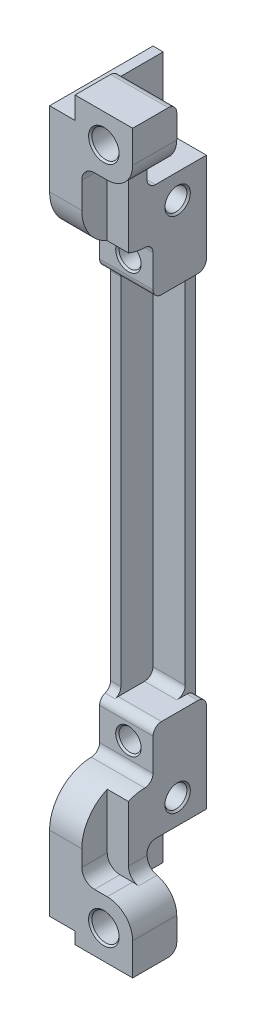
ISO-10303-21;
HEADER;
FILE_DESCRIPTION(('STEP AP214'),'2;1');
FILE_NAME('part.step','',(''),(''),'','','');
FILE_SCHEMA(('AUTOMOTIVE_DESIGN { 1 0 10303 214 1 1 1 1 }'));
ENDSEC;
DATA;
#1=APPLICATION_CONTEXT('core data for automotive mechanical design processes');
#2=APPLICATION_PROTOCOL_DEFINITION('international standard','automotive_design',2000,#1);
#3=PRODUCT_CONTEXT('',#1,'mechanical');
#4=PRODUCT('Part','Part','',(#3));
#5=PRODUCT_RELATED_PRODUCT_CATEGORY('part','',(#4));
#6=PRODUCT_DEFINITION_FORMATION('','',#4);
#7=PRODUCT_DEFINITION_CONTEXT('part definition',#1,'design');
#8=PRODUCT_DEFINITION('design','',#6,#7);
#9=PRODUCT_DEFINITION_SHAPE('','',#8);
#10=(LENGTH_UNIT() NAMED_UNIT(*) SI_UNIT(.MILLI.,.METRE.));
#11=(NAMED_UNIT(*) PLANE_ANGLE_UNIT() SI_UNIT($,.RADIAN.));
#12=(NAMED_UNIT(*) SI_UNIT($,.STERADIAN.) SOLID_ANGLE_UNIT());
#13=UNCERTAINTY_MEASURE_WITH_UNIT(LENGTH_MEASURE(1.E-05),#10,'distance_accuracy_value','');
#14=(GEOMETRIC_REPRESENTATION_CONTEXT(3) GLOBAL_UNCERTAINTY_ASSIGNED_CONTEXT((#13)) GLOBAL_UNIT_ASSIGNED_CONTEXT((#10,
#11,#12)) REPRESENTATION_CONTEXT('',''));
#15=CARTESIAN_POINT('',(0.,0.,0.));
#16=DIRECTION('',(0.,0.,1.));
#17=DIRECTION('',(1.,0.,0.));
#18=AXIS2_PLACEMENT_3D('',#15,#16,#17);
#19=CARTESIAN_POINT('',(-0.237352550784,62.2,2.2));
#20=DIRECTION('',(1.,0.,0.));
#21=DIRECTION('',(0.,0.,-1.));
#22=AXIS2_PLACEMENT_3D('',#19,#20,#21);
#23=CYLINDRICAL_SURFACE('',#22,1.);
#24=CARTESIAN_POINT('',(5.,62.2,2.2));
#25=DIRECTION('',(1.,0.,0.));
#26=DIRECTION('',(0.,0.,-1.));
#27=AXIS2_PLACEMENT_3D('',#24,#25,#26);
#28=CIRCLE('',#27,1.);
#29=CARTESIAN_POINT('',(5.,63.2,2.2));
#30=VERTEX_POINT('',#29);
#31=CARTESIAN_POINT('',(5.,62.2,1.2));
#32=VERTEX_POINT('',#31);
#33=EDGE_CURVE('E368',#30,#32,#28,.F.);
#34=ORIENTED_EDGE('',*,*,#33,.F.);
#35=DIRECTION('',(1.,0.,0.));
#36=VECTOR('',#35,1.);
#37=CARTESIAN_POINT('',(0.,63.2,2.2));
#38=LINE('',#37,#36);
#39=CARTESIAN_POINT('',(1.2,63.2,2.2));
#40=VERTEX_POINT('',#39);
#41=EDGE_CURVE('E370',#40,#30,#38,.T.);
#42=ORIENTED_EDGE('',*,*,#41,.F.);
#43=CARTESIAN_POINT('',(1.2,62.2,2.2));
#44=DIRECTION('',(1.,0.,0.));
#45=DIRECTION('',(0.,0.,-1.));
#46=AXIS2_PLACEMENT_3D('',#43,#44,#45);
#47=CIRCLE('',#46,1.);
#48=CARTESIAN_POINT('',(1.2,62.2,1.2));
#49=VERTEX_POINT('',#48);
#50=EDGE_CURVE('E20',#49,#40,#47,.T.);
#51=ORIENTED_EDGE('',*,*,#50,.F.);
#52=DIRECTION('',(1.,0.,0.));
#53=VECTOR('',#52,1.);
#54=CARTESIAN_POINT('',(5.,62.2,1.2));
#55=LINE('',#54,#53);
#56=EDGE_CURVE('E456',#32,#49,#55,.F.);
#57=ORIENTED_EDGE('',*,*,#56,.F.);
#58=EDGE_LOOP('',(#34,#42,#51,#57));
#59=FACE_BOUND('',#58,.T.);
#60=ADVANCED_FACE('F17',(#59),#23,.F.);
#61=CARTESIAN_POINT('',(6.442821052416,20.6,2.2));
#62=DIRECTION('',(-1.,0.,0.));
#63=DIRECTION('',(0.,0.,1.));
#64=AXIS2_PLACEMENT_3D('',#61,#62,#63);
#65=CYLINDRICAL_SURFACE('',#64,1.);
#66=DIRECTION('',(1.,0.,0.));
#67=VECTOR('',#66,1.);
#68=CARTESIAN_POINT('',(0.,19.6,2.2));
#69=LINE('',#68,#67);
#70=CARTESIAN_POINT('',(5.,19.6,2.2));
#71=VERTEX_POINT('',#70);
#72=CARTESIAN_POINT('',(1.2,19.6,2.2));
#73=VERTEX_POINT('',#72);
#74=EDGE_CURVE('E453',#71,#73,#69,.F.);
#75=ORIENTED_EDGE('',*,*,#74,.F.);
#76=CARTESIAN_POINT('',(5.,20.6,2.2));
#77=DIRECTION('',(-1.,0.,0.));
#78=DIRECTION('',(0.,0.,1.));
#79=AXIS2_PLACEMENT_3D('',#76,#77,#78);
#80=CIRCLE('',#79,1.);
#81=CARTESIAN_POINT('',(5.,20.6,1.2));
#82=VERTEX_POINT('',#81);
#83=EDGE_CURVE('E682',#82,#71,#80,.T.);
#84=ORIENTED_EDGE('',*,*,#83,.F.);
#85=DIRECTION('',(1.,0.,0.));
#86=VECTOR('',#85,1.);
#87=CARTESIAN_POINT('',(5.,20.6,1.2));
#88=LINE('',#87,#86);
#89=CARTESIAN_POINT('',(1.2,20.6,1.2));
#90=VERTEX_POINT('',#89);
#91=EDGE_CURVE('E458',#90,#82,#88,.T.);
#92=ORIENTED_EDGE('',*,*,#91,.F.);
#93=CARTESIAN_POINT('',(1.2,20.6,2.2));
#94=DIRECTION('',(-1.,0.,0.));
#95=DIRECTION('',(0.,0.,1.));
#96=AXIS2_PLACEMENT_3D('',#93,#94,#95);
#97=CIRCLE('',#96,1.);
#98=EDGE_CURVE('E500',#73,#90,#97,.F.);
#99=ORIENTED_EDGE('',*,*,#98,.F.);
#100=EDGE_LOOP('',(#75,#84,#92,#99));
#101=FACE_BOUND('',#100,.T.);
#102=ADVANCED_FACE('F1795',(#101),#65,.F.);
#103=CARTESIAN_POINT('',(9.8,78.6,7.));
#104=DIRECTION('',(0.,1.,0.));
#105=DIRECTION('',(0.,0.,1.));
#106=AXIS2_PLACEMENT_3D('',#103,#104,#105);
#107=PLANE('',#106);
#108=DIRECTION('',(0.,0.,-1.));
#109=VECTOR('',#108,1.);
#110=CARTESIAN_POINT('',(6.8,78.6,12.35648));
#111=LINE('',#110,#109);
#112=CARTESIAN_POINT('',(6.8,78.6,12.2));
#113=VERTEX_POINT('',#112);
#114=CARTESIAN_POINT('',(6.8,78.6,9.2));
#115=VERTEX_POINT('',#114);
#116=EDGE_CURVE('E496',#113,#115,#111,.T.);
#117=ORIENTED_EDGE('',*,*,#116,.F.);
#118=DIRECTION('',(1.,0.,0.));
#119=VECTOR('',#118,1.);
#120=CARTESIAN_POINT('',(9.8,78.6,12.2));
#121=LINE('',#120,#119);
#122=CARTESIAN_POINT('',(5.3,78.6,12.2));
#123=VERTEX_POINT('',#122);
#124=EDGE_CURVE('E498',#123,#113,#121,.T.);
#125=ORIENTED_EDGE('',*,*,#124,.F.);
#126=DIRECTION('',(0.,0.,-1.));
#127=VECTOR('',#126,1.);
#128=CARTESIAN_POINT('',(5.3,78.6,12.35648));
#129=LINE('',#128,#127);
#130=CARTESIAN_POINT('',(5.3,78.6,9.2));
#131=VERTEX_POINT('',#130);
#132=EDGE_CURVE('E659',#123,#131,#129,.T.);
#133=ORIENTED_EDGE('',*,*,#132,.T.);
#134=DIRECTION('',(-1.,0.,0.));
#135=VECTOR('',#134,1.);
#136=CARTESIAN_POINT('',(6.3,78.6,9.2));
#137=LINE('',#136,#135);
#138=EDGE_CURVE('E497',#131,#115,#137,.F.);
#139=ORIENTED_EDGE('',*,*,#138,.T.);
#140=EDGE_LOOP('',(#117,#125,#133,#139));
#141=FACE_BOUND('',#140,.T.);
#142=ADVANCED_FACE('F996',(#141),#107,.F.);
#143=CARTESIAN_POINT('',(6.4,82.,13.));
#144=DIRECTION('',(0.,0.,1.));
#145=DIRECTION('',(1.,0.,0.));
#146=AXIS2_PLACEMENT_3D('',#143,#144,#145);
#147=CYLINDRICAL_SURFACE('',#146,1.6);
#148=CARTESIAN_POINT('',(6.4,82.,7.20002500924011));
#149=DIRECTION('',(0.,0.,-1.));
#150=DIRECTION('',(0.,-1.,0.));
#151=AXIS2_PLACEMENT_3D('',#148,#149,#150);
#152=CIRCLE('',#151,1.60000000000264);
#153=CARTESIAN_POINT('',(6.4,80.3999999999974,7.20002500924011));
#154=VERTEX_POINT('',#153);
#155=EDGE_CURVE('E488',#154,#154,#152,.T.);
#156=ORIENTED_EDGE('',*,*,#155,.T.);
#157=EDGE_LOOP('',(#156));
#158=FACE_BOUND('',#157,.T.);
#159=CARTESIAN_POINT('',(6.4,82.,12.0001295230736));
#160=DIRECTION('',(0.,0.,1.));
#161=DIRECTION('',(0.,-1.,0.));
#162=AXIS2_PLACEMENT_3D('',#159,#160,#161);
#163=CIRCLE('',#162,1.60000000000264);
#164=CARTESIAN_POINT('',(6.4,80.3999999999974,12.0001295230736));
#165=VERTEX_POINT('',#164);
#166=EDGE_CURVE('E482',#165,#165,#163,.T.);
#167=ORIENTED_EDGE('',*,*,#166,.T.);
#168=EDGE_LOOP('',(#167));
#169=FACE_BOUND('',#168,.T.);
#170=ADVANCED_FACE('F1779',(#158,#169),#147,.F.);
#171=CARTESIAN_POINT('',(2.769192,84.4,8.));
#172=DIRECTION('',(1.,0.,0.));
#173=DIRECTION('',(0.,0.,-1.));
#174=AXIS2_PLACEMENT_3D('',#171,#172,#173);
#175=CYLINDRICAL_SURFACE('',#174,1.);
#176=DIRECTION('',(1.,0.,0.));
#177=VECTOR('',#176,1.);
#178=CARTESIAN_POINT('',(0.,85.4,8.));
#179=LINE('',#178,#177);
#180=CARTESIAN_POINT('',(9.8,85.4,8.));
#181=VERTEX_POINT('',#180);
#182=CARTESIAN_POINT('',(3.,85.4,8.));
#183=VERTEX_POINT('',#182);
#184=EDGE_CURVE('E483',#181,#183,#179,.F.);
#185=ORIENTED_EDGE('',*,*,#184,.F.);
#186=CARTESIAN_POINT('',(9.8,84.4,8.));
#187=DIRECTION('',(1.,0.,0.));
#188=DIRECTION('',(0.,0.,-1.));
#189=AXIS2_PLACEMENT_3D('',#186,#187,#188);
#190=CIRCLE('',#189,1.);
#191=CARTESIAN_POINT('',(9.8,84.4,7.));
#192=VERTEX_POINT('',#191);
#193=EDGE_CURVE('E660',#181,#192,#190,.F.);
#194=ORIENTED_EDGE('',*,*,#193,.T.);
#195=DIRECTION('',(-1.,0.,0.));
#196=VECTOR('',#195,1.);
#197=CARTESIAN_POINT('',(0.,84.4,7.));
#198=LINE('',#197,#196);
#199=CARTESIAN_POINT('',(3.,84.4,7.));
#200=VERTEX_POINT('',#199);
#201=EDGE_CURVE('E478',#200,#192,#198,.F.);
#202=ORIENTED_EDGE('',*,*,#201,.F.);
#203=CARTESIAN_POINT('',(3.,84.4,8.));
#204=DIRECTION('',(1.,0.,0.));
#205=DIRECTION('',(0.,0.,-1.));
#206=AXIS2_PLACEMENT_3D('',#203,#204,#205);
#207=CIRCLE('',#206,1.);
#208=EDGE_CURVE('E491',#200,#183,#207,.T.);
#209=ORIENTED_EDGE('',*,*,#208,.T.);
#210=EDGE_LOOP('',(#185,#194,#202,#209));
#211=FACE_BOUND('',#210,.T.);
#212=ADVANCED_FACE('F1120',(#211),#175,.T.);
#213=CARTESIAN_POINT('',(6.4,82.,7.000000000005));
#214=DIRECTION('',(0.,0.,-1.));
#215=DIRECTION('',(-1.,0.,0.));
#216=AXIS2_PLACEMENT_3D('',#213,#214,#215);
#217=CONICAL_SURFACE('',#216,1.80002813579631,0.785405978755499);
#218=ORIENTED_EDGE('',*,*,#155,.F.);
#219=EDGE_LOOP('',(#218));
#220=FACE_BOUND('',#219,.T.);
#221=CARTESIAN_POINT('',(6.4,82.,7.000000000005));
#222=DIRECTION('',(0.,0.,-1.));
#223=DIRECTION('',(-1.,0.,0.));
#224=AXIS2_PLACEMENT_3D('',#221,#222,#223);
#225=CIRCLE('',#224,1.80002813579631);
#226=CARTESIAN_POINT('',(4.59997186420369,82.,7.000000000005));
#227=VERTEX_POINT('',#226);
#228=EDGE_CURVE('E468',#227,#227,#225,.F.);
#229=ORIENTED_EDGE('',*,*,#228,.F.);
#230=EDGE_LOOP('',(#229));
#231=FACE_BOUND('',#230,.T.);
#232=ADVANCED_FACE('F1762',(#220,#231),#217,.F.);
#233=CARTESIAN_POINT('',(1.2,75.8,6.));
#234=DIRECTION('',(1.,0.,0.));
#235=DIRECTION('',(0.,0.,-1.));
#236=AXIS2_PLACEMENT_3D('',#233,#234,#235);
#237=CYLINDRICAL_SURFACE('',#236,1.);
#238=DIRECTION('',(1.,0.,0.));
#239=VECTOR('',#238,1.);
#240=CARTESIAN_POINT('',(1.2,74.8,6.));
#241=LINE('',#240,#239);
#242=CARTESIAN_POINT('',(6.3,74.8,6.));
#243=VERTEX_POINT('',#242);
#244=CARTESIAN_POINT('',(1.2,74.8,6.));
#245=VERTEX_POINT('',#244);
#246=EDGE_CURVE('E474',#243,#245,#241,.F.);
#247=ORIENTED_EDGE('',*,*,#246,.T.);
#248=CARTESIAN_POINT('',(1.2,75.8,6.));
#249=DIRECTION('',(1.,0.,0.));
#250=DIRECTION('',(0.,0.,-1.));
#251=AXIS2_PLACEMENT_3D('',#248,#249,#250);
#252=CIRCLE('',#251,1.);
#253=CARTESIAN_POINT('',(1.2,75.8,7.));
#254=VERTEX_POINT('',#253);
#255=EDGE_CURVE('E477',#254,#245,#252,.T.);
#256=ORIENTED_EDGE('',*,*,#255,.F.);
#257=DIRECTION('',(-1.,0.,0.));
#258=VECTOR('',#257,1.);
#259=CARTESIAN_POINT('',(0.,75.8,7.));
#260=LINE('',#259,#258);
#261=CARTESIAN_POINT('',(6.3,75.8,7.));
#262=VERTEX_POINT('',#261);
#263=EDGE_CURVE('E466',#262,#254,#260,.T.);
#264=ORIENTED_EDGE('',*,*,#263,.F.);
#265=CARTESIAN_POINT('',(6.3,75.8,6.));
#266=DIRECTION('',(1.,0.,0.));
#267=DIRECTION('',(0.,0.,-1.));
#268=AXIS2_PLACEMENT_3D('',#265,#266,#267);
#269=CIRCLE('',#268,1.);
#270=EDGE_CURVE('E375',#243,#262,#269,.F.);
#271=ORIENTED_EDGE('',*,*,#270,.F.);
#272=EDGE_LOOP('',(#247,#256,#264,#271));
#273=FACE_BOUND('',#272,.T.);
#274=ADVANCED_FACE('F1754',(#273),#237,.F.);
#275=CARTESIAN_POINT('',(0.,63.2,0.));
#276=DIRECTION('',(0.,-1.,0.));
#277=DIRECTION('',(0.,0.,-1.));
#278=AXIS2_PLACEMENT_3D('',#275,#276,#277);
#279=PLANE('',#278);
#280=DIRECTION('',(0.,0.,1.));
#281=VECTOR('',#280,1.);
#282=CARTESIAN_POINT('',(6.3,63.2,3.5));
#283=LINE('',#282,#281);
#284=CARTESIAN_POINT('',(6.3,63.2,1.));
#285=VERTEX_POINT('',#284);
#286=CARTESIAN_POINT('',(6.3,63.2,5.3));
#287=VERTEX_POINT('',#286);
#288=EDGE_CURVE('E644',#285,#287,#283,.T.);
#289=ORIENTED_EDGE('',*,*,#288,.T.);
#290=DIRECTION('',(1.,0.,0.));
#291=VECTOR('',#290,1.);
#292=CARTESIAN_POINT('',(-0.15648,63.2,5.3));
#293=LINE('',#292,#291);
#294=CARTESIAN_POINT('',(1.2,63.2,5.3));
#295=VERTEX_POINT('',#294);
#296=EDGE_CURVE('E379',#295,#287,#293,.T.);
#297=ORIENTED_EDGE('',*,*,#296,.F.);
#298=DIRECTION('',(0.,0.,-1.));
#299=VECTOR('',#298,1.);
#300=CARTESIAN_POINT('',(1.2,63.2,1.2));
#301=LINE('',#300,#299);
#302=EDGE_CURVE('E364',#40,#295,#301,.F.);
#303=ORIENTED_EDGE('',*,*,#302,.F.);
#304=ORIENTED_EDGE('',*,*,#41,.T.);
#305=DIRECTION('',(0.,0.,-1.));
#306=VECTOR('',#305,1.);
#307=CARTESIAN_POINT('',(5.,63.2,0.));
#308=LINE('',#307,#306);
#309=CARTESIAN_POINT('',(5.,63.2,1.));
#310=VERTEX_POINT('',#309);
#311=EDGE_CURVE('E374',#30,#310,#308,.T.);
#312=ORIENTED_EDGE('',*,*,#311,.T.);
#313=DIRECTION('',(1.,0.,0.));
#314=VECTOR('',#313,1.);
#315=CARTESIAN_POINT('',(0.,63.2,1.));
#316=LINE('',#315,#314);
#317=EDGE_CURVE('E461',#310,#285,#316,.T.);
#318=ORIENTED_EDGE('',*,*,#317,.T.);
#319=EDGE_LOOP('',(#289,#297,#303,#304,#312,#318));
#320=FACE_BOUND('',#319,.T.);
#321=ADVANCED_FACE('F377',(#320),#279,.T.);
#322=CARTESIAN_POINT('',(7.8,77.2125178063,12.34131625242));
#323=DIRECTION('',(0.,0.,-1.));
#324=DIRECTION('',(-1.,0.,0.));
#325=AXIS2_PLACEMENT_3D('',#322,#323,#324);
#326=CYLINDRICAL_SURFACE('',#325,1.5);
#327=CARTESIAN_POINT('',(7.8,77.2125178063,7.));
#328=DIRECTION('',(0.,0.,-1.));
#329=DIRECTION('',(-1.,0.,0.));
#330=AXIS2_PLACEMENT_3D('',#327,#328,#329);
#331=CIRCLE('',#330,1.5);
#332=CARTESIAN_POINT('',(7.46666666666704,78.6750118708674,7.));
#333=VERTEX_POINT('',#332);
#334=CARTESIAN_POINT('',(6.3,77.2125178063,7.));
#335=VERTEX_POINT('',#334);
#336=EDGE_CURVE('E469',#333,#335,#331,.F.);
#337=ORIENTED_EDGE('',*,*,#336,.F.);
#338=DIRECTION('',(0.,0.,-1.));
#339=VECTOR('',#338,1.);
#340=CARTESIAN_POINT('',(7.46666666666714,78.6750118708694,12.35648));
#341=LINE('',#340,#339);
#342=CARTESIAN_POINT('',(7.46666666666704,78.6750118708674,9.2));
#343=VERTEX_POINT('',#342);
#344=EDGE_CURVE('E494',#343,#333,#341,.T.);
#345=ORIENTED_EDGE('',*,*,#344,.F.);
#346=CARTESIAN_POINT('',(7.8,77.2125178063,9.2));
#347=DIRECTION('',(0.,0.,-1.));
#348=DIRECTION('',(-1.,0.,0.));
#349=AXIS2_PLACEMENT_3D('',#346,#347,#348);
#350=CIRCLE('',#349,1.5);
#351=CARTESIAN_POINT('',(6.3,77.2125178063,9.2));
#352=VERTEX_POINT('',#351);
#353=EDGE_CURVE('E666',#343,#352,#350,.F.);
#354=ORIENTED_EDGE('',*,*,#353,.T.);
#355=DIRECTION('',(0.,0.,1.));
#356=VECTOR('',#355,1.);
#357=CARTESIAN_POINT('',(6.3,77.2125178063,3.5));
#358=LINE('',#357,#356);
#359=EDGE_CURVE('E462',#352,#335,#358,.F.);
#360=ORIENTED_EDGE('',*,*,#359,.T.);
#361=EDGE_LOOP('',(#337,#345,#354,#360));
#362=FACE_BOUND('',#361,.T.);
#363=ADVANCED_FACE('F1115',(#362),#326,.F.);
#364=CARTESIAN_POINT('',(5.,0.,1.2));
#365=DIRECTION('',(0.,0.,1.));
#366=DIRECTION('',(1.,0.,0.));
#367=AXIS2_PLACEMENT_3D('',#364,#365,#366);
#368=PLANE('',#367);
#369=ORIENTED_EDGE('',*,*,#56,.T.);
#370=DIRECTION('',(0.,1.,0.));
#371=VECTOR('',#370,1.);
#372=CARTESIAN_POINT('',(1.2,0.,1.2));
#373=LINE('',#372,#371);
#374=EDGE_CURVE('E367',#90,#49,#373,.T.);
#375=ORIENTED_EDGE('',*,*,#374,.F.);
#376=ORIENTED_EDGE('',*,*,#91,.T.);
#377=DIRECTION('',(0.,1.,0.));
#378=VECTOR('',#377,1.);
#379=CARTESIAN_POINT('',(5.,0.,1.2));
#380=LINE('',#379,#378);
#381=EDGE_CURVE('E636',#32,#82,#380,.F.);
#382=ORIENTED_EDGE('',*,*,#381,.F.);
#383=EDGE_LOOP('',(#369,#375,#376,#382));
#384=FACE_BOUND('',#383,.T.);
#385=ADVANCED_FACE('F689',(#384),#368,.T.);
#386=CARTESIAN_POINT('',(0.,19.6,6.3));
#387=DIRECTION('',(0.,1.,0.));
#388=DIRECTION('',(0.,0.,1.));
#389=AXIS2_PLACEMENT_3D('',#386,#387,#388);
#390=PLANE('',#389);
#391=DIRECTION('',(0.,0.,-1.));
#392=VECTOR('',#391,1.);
#393=CARTESIAN_POINT('',(5.,19.6,0.));
#394=LINE('',#393,#392);
#395=CARTESIAN_POINT('',(5.,19.6,1.));
#396=VERTEX_POINT('',#395);
#397=EDGE_CURVE('E632',#71,#396,#394,.T.);
#398=ORIENTED_EDGE('',*,*,#397,.F.);
#399=ORIENTED_EDGE('',*,*,#74,.T.);
#400=DIRECTION('',(0.,0.,-1.));
#401=VECTOR('',#400,1.);
#402=CARTESIAN_POINT('',(1.2,19.6,1.2));
#403=LINE('',#402,#401);
#404=CARTESIAN_POINT('',(1.2,19.6,5.3));
#405=VERTEX_POINT('',#404);
#406=EDGE_CURVE('E385',#405,#73,#403,.T.);
#407=ORIENTED_EDGE('',*,*,#406,.F.);
#408=DIRECTION('',(1.,0.,0.));
#409=VECTOR('',#408,1.);
#410=CARTESIAN_POINT('',(-0.15648,19.6,5.3));
#411=LINE('',#410,#409);
#412=CARTESIAN_POINT('',(6.3,19.6,5.3));
#413=VERTEX_POINT('',#412);
#414=EDGE_CURVE('E396',#413,#405,#411,.F.);
#415=ORIENTED_EDGE('',*,*,#414,.F.);
#416=DIRECTION('',(0.,0.,1.));
#417=VECTOR('',#416,1.);
#418=CARTESIAN_POINT('',(6.3,19.6,3.5));
#419=LINE('',#418,#417);
#420=CARTESIAN_POINT('',(6.3,19.6,1.));
#421=VERTEX_POINT('',#420);
#422=EDGE_CURVE('E620',#413,#421,#419,.F.);
#423=ORIENTED_EDGE('',*,*,#422,.T.);
#424=DIRECTION('',(1.,0.,0.));
#425=VECTOR('',#424,1.);
#426=CARTESIAN_POINT('',(-0.161184,19.6,1.));
#427=LINE('',#426,#425);
#428=EDGE_CURVE('E446',#396,#421,#427,.T.);
#429=ORIENTED_EDGE('',*,*,#428,.F.);
#430=EDGE_LOOP('',(#398,#399,#407,#415,#423,#429));
#431=FACE_BOUND('',#430,.T.);
#432=ADVANCED_FACE('F1723',(#431),#390,.T.);
#433=CARTESIAN_POINT('',(3.4,66.1,0.));
#434=DIRECTION('',(0.,0.,-1.));
#435=DIRECTION('',(-1.,0.,0.));
#436=AXIS2_PLACEMENT_3D('',#433,#434,#435);
#437=CYLINDRICAL_SURFACE('',#436,1.3);
#438=CARTESIAN_POINT('',(3.4,66.1,6.10000016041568));
#439=DIRECTION('',(0.,0.,1.));
#440=DIRECTION('',(0.,-1.,0.));
#441=AXIS2_PLACEMENT_3D('',#438,#439,#440);
#442=CIRCLE('',#441,1.30000000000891);
#443=CARTESIAN_POINT('',(3.4,64.7999999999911,6.10000016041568));
#444=VERTEX_POINT('',#443);
#445=EDGE_CURVE('E670',#444,#444,#442,.T.);
#446=ORIENTED_EDGE('',*,*,#445,.T.);
#447=EDGE_LOOP('',(#446));
#448=FACE_BOUND('',#447,.T.);
#449=CARTESIAN_POINT('',(3.4,66.1,1.00016099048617));
#450=DIRECTION('',(0.,0.,-1.));
#451=DIRECTION('',(0.,-1.,0.));
#452=AXIS2_PLACEMENT_3D('',#449,#450,#451);
#453=CIRCLE('',#452,1.29999999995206);
#454=CARTESIAN_POINT('',(3.4,64.8000000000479,1.00016099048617));
#455=VERTEX_POINT('',#454);
#456=EDGE_CURVE('E883',#455,#455,#453,.T.);
#457=ORIENTED_EDGE('',*,*,#456,.T.);
#458=EDGE_LOOP('',(#457));
#459=FACE_BOUND('',#458,.T.);
#460=ADVANCED_FACE('F1714',(#448,#459),#437,.F.);
#461=CARTESIAN_POINT('',(3.4,16.7,0.));
#462=DIRECTION('',(0.,0.,-1.));
#463=DIRECTION('',(-1.,0.,0.));
#464=AXIS2_PLACEMENT_3D('',#461,#462,#463);
#465=CYLINDRICAL_SURFACE('',#464,1.3);
#466=CARTESIAN_POINT('',(3.4,16.7,6.10000016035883));
#467=DIRECTION('',(0.,0.,1.));
#468=DIRECTION('',(0.,-1.,0.));
#469=AXIS2_PLACEMENT_3D('',#466,#467,#468);
#470=CIRCLE('',#469,1.29999999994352);
#471=CARTESIAN_POINT('',(3.4,15.4000000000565,6.10000016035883));
#472=VERTEX_POINT('',#471);
#473=EDGE_CURVE('E393',#472,#472,#470,.T.);
#474=ORIENTED_EDGE('',*,*,#473,.T.);
#475=EDGE_LOOP('',(#474));
#476=FACE_BOUND('',#475,.T.);
#477=CARTESIAN_POINT('',(3.4,16.7,1.00016099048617));
#478=DIRECTION('',(0.,0.,-1.));
#479=DIRECTION('',(0.,-1.,0.));
#480=AXIS2_PLACEMENT_3D('',#477,#478,#479);
#481=CIRCLE('',#480,1.30000000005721);
#482=CARTESIAN_POINT('',(3.4,15.3999999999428,1.00016099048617));
#483=VERTEX_POINT('',#482);
#484=EDGE_CURVE('E873',#483,#483,#481,.T.);
#485=ORIENTED_EDGE('',*,*,#484,.T.);
#486=EDGE_LOOP('',(#485));
#487=FACE_BOUND('',#486,.T.);
#488=ADVANCED_FACE('F1705',(#476,#487),#465,.F.);
#489=CARTESIAN_POINT('',(1.2,7.,6.));
#490=DIRECTION('',(1.,0.,0.));
#491=DIRECTION('',(0.,0.,-1.));
#492=AXIS2_PLACEMENT_3D('',#489,#490,#491);
#493=CYLINDRICAL_SURFACE('',#492,1.);
#494=DIRECTION('',(-1.,0.,0.));
#495=VECTOR('',#494,1.);
#496=CARTESIAN_POINT('',(0.,7.,7.));
#497=LINE('',#496,#495);
#498=CARTESIAN_POINT('',(1.2,7.,7.));
#499=VERTEX_POINT('',#498);
#500=CARTESIAN_POINT('',(6.3,7.,7.));
#501=VERTEX_POINT('',#500);
#502=EDGE_CURVE('E434',#499,#501,#497,.F.);
#503=ORIENTED_EDGE('',*,*,#502,.F.);
#504=CARTESIAN_POINT('',(1.2,7.,6.));
#505=DIRECTION('',(1.,0.,0.));
#506=DIRECTION('',(0.,0.,-1.));
#507=AXIS2_PLACEMENT_3D('',#504,#505,#506);
#508=CIRCLE('',#507,1.);
#509=CARTESIAN_POINT('',(1.2,8.,6.));
#510=VERTEX_POINT('',#509);
#511=EDGE_CURVE('E613',#510,#499,#508,.T.);
#512=ORIENTED_EDGE('',*,*,#511,.F.);
#513=DIRECTION('',(1.,0.,0.));
#514=VECTOR('',#513,1.);
#515=CARTESIAN_POINT('',(1.2,8.,6.));
#516=LINE('',#515,#514);
#517=CARTESIAN_POINT('',(6.3,8.,6.));
#518=VERTEX_POINT('',#517);
#519=EDGE_CURVE('E442',#510,#518,#516,.T.);
#520=ORIENTED_EDGE('',*,*,#519,.T.);
#521=CARTESIAN_POINT('',(6.3,7.,6.));
#522=DIRECTION('',(1.,0.,0.));
#523=DIRECTION('',(0.,0.,-1.));
#524=AXIS2_PLACEMENT_3D('',#521,#522,#523);
#525=CIRCLE('',#524,1.);
#526=EDGE_CURVE('E441',#518,#501,#525,.T.);
#527=ORIENTED_EDGE('',*,*,#526,.T.);
#528=EDGE_LOOP('',(#503,#512,#520,#527));
#529=FACE_BOUND('',#528,.T.);
#530=ADVANCED_FACE('F1696',(#529),#493,.F.);
#531=CARTESIAN_POINT('',(6.4,2.,6.99999999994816));
#532=DIRECTION('',(0.,0.,-1.));
#533=DIRECTION('',(-1.,0.,0.));
#534=AXIS2_PLACEMENT_3D('',#531,#532,#533);
#535=CONICAL_SURFACE('',#534,1.80002813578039,0.785405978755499);
#536=CARTESIAN_POINT('',(6.4,2.,7.20002500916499));
#537=DIRECTION('',(0.,0.,1.));
#538=DIRECTION('',(1.,0.,0.));
#539=AXIS2_PLACEMENT_3D('',#536,#537,#538);
#540=CIRCLE('',#539,1.6);
#541=CARTESIAN_POINT('',(8.,2.,7.20002500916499));
#542=VERTEX_POINT('',#541);
#543=EDGE_CURVE('E412',#542,#542,#540,.T.);
#544=ORIENTED_EDGE('',*,*,#543,.T.);
#545=EDGE_LOOP('',(#544));
#546=FACE_BOUND('',#545,.T.);
#547=CARTESIAN_POINT('',(6.4,2.,6.99999999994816));
#548=DIRECTION('',(0.,0.,-1.));
#549=DIRECTION('',(-1.,0.,0.));
#550=AXIS2_PLACEMENT_3D('',#547,#548,#549);
#551=CIRCLE('',#550,1.80002813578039);
#552=CARTESIAN_POINT('',(4.59997186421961,2.,6.99999999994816));
#553=VERTEX_POINT('',#552);
#554=EDGE_CURVE('E607',#553,#553,#551,.F.);
#555=ORIENTED_EDGE('',*,*,#554,.F.);
#556=EDGE_LOOP('',(#555));
#557=FACE_BOUND('',#556,.T.);
#558=ADVANCED_FACE('F1687',(#546,#557),#535,.F.);
#559=CARTESIAN_POINT('',(2.84352,-0.4,8.));
#560=DIRECTION('',(1.,0.,0.));
#561=DIRECTION('',(0.,0.,-1.));
#562=AXIS2_PLACEMENT_3D('',#559,#560,#561);
#563=CYLINDRICAL_SURFACE('',#562,1.);
#564=DIRECTION('',(-1.,0.,0.));
#565=VECTOR('',#564,1.);
#566=CARTESIAN_POINT('',(0.,-0.4,7.));
#567=LINE('',#566,#565);
#568=CARTESIAN_POINT('',(9.8,-0.4,7.));
#569=VERTEX_POINT('',#568);
#570=CARTESIAN_POINT('',(3.,-0.4,7.));
#571=VERTEX_POINT('',#570);
#572=EDGE_CURVE('E430',#569,#571,#567,.T.);
#573=ORIENTED_EDGE('',*,*,#572,.F.);
#574=CARTESIAN_POINT('',(9.8,-0.4,8.));
#575=DIRECTION('',(1.,0.,0.));
#576=DIRECTION('',(0.,0.,-1.));
#577=AXIS2_PLACEMENT_3D('',#574,#575,#576);
#578=CIRCLE('',#577,1.);
#579=CARTESIAN_POINT('',(9.8,-1.4,8.));
#580=VERTEX_POINT('',#579);
#581=EDGE_CURVE('E419',#569,#580,#578,.F.);
#582=ORIENTED_EDGE('',*,*,#581,.T.);
#583=DIRECTION('',(1.,0.,0.));
#584=VECTOR('',#583,1.);
#585=CARTESIAN_POINT('',(0.,-1.4,8.));
#586=LINE('',#585,#584);
#587=CARTESIAN_POINT('',(3.,-1.4,8.));
#588=VERTEX_POINT('',#587);
#589=EDGE_CURVE('E425',#588,#580,#586,.T.);
#590=ORIENTED_EDGE('',*,*,#589,.F.);
#591=CARTESIAN_POINT('',(3.,-0.4,8.));
#592=DIRECTION('',(1.,0.,0.));
#593=DIRECTION('',(0.,0.,-1.));
#594=AXIS2_PLACEMENT_3D('',#591,#592,#593);
#595=CIRCLE('',#594,1.);
#596=EDGE_CURVE('E603',#571,#588,#595,.F.);
#597=ORIENTED_EDGE('',*,*,#596,.F.);
#598=EDGE_LOOP('',(#573,#582,#590,#597));
#599=FACE_BOUND('',#598,.T.);
#600=ADVANCED_FACE('F1678',(#599),#563,.T.);
#601=CARTESIAN_POINT('',(7.8,6.787482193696,-0.1785165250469));
#602=DIRECTION('',(0.,0.,1.));
#603=DIRECTION('',(1.,0.,0.));
#604=AXIS2_PLACEMENT_3D('',#601,#602,#603);
#605=CYLINDRICAL_SURFACE('',#604,1.5);
#606=DIRECTION('',(0.,0.,1.));
#607=VECTOR('',#606,1.);
#608=CARTESIAN_POINT('',(6.3,6.787482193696,3.5));
#609=LINE('',#608,#607);
#610=CARTESIAN_POINT('',(6.3,6.787482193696,7.));
#611=VERTEX_POINT('',#610);
#612=CARTESIAN_POINT('',(6.3,6.787482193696,9.2));
#613=VERTEX_POINT('',#612);
#614=EDGE_CURVE('E438',#611,#613,#609,.T.);
#615=ORIENTED_EDGE('',*,*,#614,.T.);
#616=CARTESIAN_POINT('',(7.8,6.787482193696,9.2));
#617=DIRECTION('',(0.,0.,1.));
#618=DIRECTION('',(1.,0.,0.));
#619=AXIS2_PLACEMENT_3D('',#616,#617,#618);
#620=CIRCLE('',#619,1.5);
#621=CARTESIAN_POINT('',(7.46666666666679,5.32498812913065,9.2));
#622=VERTEX_POINT('',#621);
#623=EDGE_CURVE('E407',#613,#622,#620,.T.);
#624=ORIENTED_EDGE('',*,*,#623,.T.);
#625=DIRECTION('',(0.,0.,1.));
#626=VECTOR('',#625,1.);
#627=CARTESIAN_POINT('',(7.46666666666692,5.32498812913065,6.849196));
#628=LINE('',#627,#626);
#629=CARTESIAN_POINT('',(7.46666666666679,5.32498812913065,7.));
#630=VERTEX_POINT('',#629);
#631=EDGE_CURVE('E420',#630,#622,#628,.T.);
#632=ORIENTED_EDGE('',*,*,#631,.F.);
#633=CARTESIAN_POINT('',(7.8,6.787482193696,7.));
#634=DIRECTION('',(0.,0.,1.));
#635=DIRECTION('',(1.,0.,0.));
#636=AXIS2_PLACEMENT_3D('',#633,#634,#635);
#637=CIRCLE('',#636,1.5);
#638=EDGE_CURVE('E433',#611,#630,#637,.T.);
#639=ORIENTED_EDGE('',*,*,#638,.F.);
#640=EDGE_LOOP('',(#615,#624,#632,#639));
#641=FACE_BOUND('',#640,.T.);
#642=ADVANCED_FACE('F1669',(#641),#605,.F.);
#643=CARTESIAN_POINT('',(9.8,5.4,18.1));
#644=DIRECTION('',(0.,-1.,0.));
#645=DIRECTION('',(0.,0.,-1.));
#646=AXIS2_PLACEMENT_3D('',#643,#644,#645);
#647=PLANE('',#646);
#648=DIRECTION('',(0.,0.,1.));
#649=VECTOR('',#648,1.);
#650=CARTESIAN_POINT('',(5.3,5.4,9.049196));
#651=LINE('',#650,#649);
#652=CARTESIAN_POINT('',(5.3,5.4,9.2));
#653=VERTEX_POINT('',#652);
#654=CARTESIAN_POINT('',(5.3,5.4,12.2));
#655=VERTEX_POINT('',#654);
#656=EDGE_CURVE('E595',#653,#655,#651,.T.);
#657=ORIENTED_EDGE('',*,*,#656,.T.);
#658=DIRECTION('',(1.,0.,0.));
#659=VECTOR('',#658,1.);
#660=CARTESIAN_POINT('',(9.8,5.4,12.2));
#661=LINE('',#660,#659);
#662=CARTESIAN_POINT('',(6.8,5.4,12.2));
#663=VERTEX_POINT('',#662);
#664=EDGE_CURVE('E415',#663,#655,#661,.F.);
#665=ORIENTED_EDGE('',*,*,#664,.F.);
#666=DIRECTION('',(0.,0.,1.));
#667=VECTOR('',#666,1.);
#668=CARTESIAN_POINT('',(6.8,5.4,6.849196));
#669=LINE('',#668,#667);
#670=CARTESIAN_POINT('',(6.8,5.4,9.2));
#671=VERTEX_POINT('',#670);
#672=EDGE_CURVE('E602',#671,#663,#669,.T.);
#673=ORIENTED_EDGE('',*,*,#672,.F.);
#674=DIRECTION('',(-1.,0.,0.));
#675=VECTOR('',#674,1.);
#676=CARTESIAN_POINT('',(6.3,5.4,9.2));
#677=LINE('',#676,#675);
#678=EDGE_CURVE('E404',#671,#653,#677,.T.);
#679=ORIENTED_EDGE('',*,*,#678,.T.);
#680=EDGE_LOOP('',(#657,#665,#673,#679));
#681=FACE_BOUND('',#680,.T.);
#682=ADVANCED_FACE('F1660',(#681),#647,.F.);
#683=CARTESIAN_POINT('',(6.4,2.,13.));
#684=DIRECTION('',(0.,0.,1.));
#685=DIRECTION('',(1.,0.,0.));
#686=AXIS2_PLACEMENT_3D('',#683,#684,#685);
#687=CYLINDRICAL_SURFACE('',#686,1.6);
#688=ORIENTED_EDGE('',*,*,#543,.F.);
#689=EDGE_LOOP('',(#688));
#690=FACE_BOUND('',#689,.T.);
#691=CARTESIAN_POINT('',(6.4,2.,12.0001295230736));
#692=DIRECTION('',(0.,0.,1.));
#693=DIRECTION('',(0.,-1.,0.));
#694=AXIS2_PLACEMENT_3D('',#691,#692,#693);
#695=CIRCLE('',#694,1.59999999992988);
#696=CARTESIAN_POINT('',(6.4,0.400000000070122,12.0001295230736));
#697=VERTEX_POINT('',#696);
#698=EDGE_CURVE('E812',#697,#697,#695,.T.);
#699=ORIENTED_EDGE('',*,*,#698,.T.);
#700=EDGE_LOOP('',(#699));
#701=FACE_BOUND('',#700,.T.);
#702=ADVANCED_FACE('F1651',(#690,#701),#687,.F.);
#703=CARTESIAN_POINT('',(6.30000000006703,10.9,3.4));
#704=DIRECTION('',(1.,0.,0.));
#705=DIRECTION('',(0.,0.,-1.));
#706=AXIS2_PLACEMENT_3D('',#703,#704,#705);
#707=CONICAL_SURFACE('',#706,1.49999981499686,0.785398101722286);
#708=CARTESIAN_POINT('',(6.10000016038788,10.9,3.4));
#709=DIRECTION('',(-1.,0.,0.));
#710=DIRECTION('',(0.,0.,1.));
#711=AXIS2_PLACEMENT_3D('',#708,#709,#710);
#712=CIRCLE('',#711,1.3);
#713=CARTESIAN_POINT('',(6.10000016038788,10.9,4.7));
#714=VERTEX_POINT('',#713);
#715=EDGE_CURVE('E807',#714,#714,#712,.T.);
#716=ORIENTED_EDGE('',*,*,#715,.T.);
#717=EDGE_LOOP('',(#716));
#718=FACE_BOUND('',#717,.T.);
#719=CARTESIAN_POINT('',(6.30000000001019,10.9,3.4));
#720=DIRECTION('',(1.,0.,0.));
#721=DIRECTION('',(0.,0.,-1.));
#722=AXIS2_PLACEMENT_3D('',#719,#720,#721);
#723=CIRCLE('',#722,1.49999981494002);
#724=CARTESIAN_POINT('',(6.30000000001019,10.9,1.90000018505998));
#725=VERTEX_POINT('',#724);
#726=EDGE_CURVE('E445',#725,#725,#723,.T.);
#727=ORIENTED_EDGE('',*,*,#726,.T.);
#728=EDGE_LOOP('',(#727));
#729=FACE_BOUND('',#728,.T.);
#730=ADVANCED_FACE('F1642',(#718,#729),#707,.F.);
#731=CARTESIAN_POINT('',(6.30000000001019,71.9,3.4));
#732=DIRECTION('',(1.,0.,0.));
#733=DIRECTION('',(0.,1.,0.));
#734=AXIS2_PLACEMENT_3D('',#731,#732,#733);
#735=CONICAL_SURFACE('',#734,1.49999981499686,0.785398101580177);
#736=CARTESIAN_POINT('',(6.10000016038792,71.9,3.4));
#737=DIRECTION('',(-1.,0.,0.));
#738=DIRECTION('',(0.,0.,1.));
#739=AXIS2_PLACEMENT_3D('',#736,#737,#738);
#740=CIRCLE('',#739,1.3);
#741=CARTESIAN_POINT('',(6.10000016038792,71.9,4.7));
#742=VERTEX_POINT('',#741);
#743=EDGE_CURVE('E591',#742,#742,#740,.T.);
#744=ORIENTED_EDGE('',*,*,#743,.T.);
#745=EDGE_LOOP('',(#744));
#746=FACE_BOUND('',#745,.T.);
#747=CARTESIAN_POINT('',(6.30000000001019,71.9,3.4));
#748=DIRECTION('',(1.,0.,0.));
#749=DIRECTION('',(0.,1.,0.));
#750=AXIS2_PLACEMENT_3D('',#747,#748,#749);
#751=CIRCLE('',#750,1.49999981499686);
#752=CARTESIAN_POINT('',(6.30000000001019,73.3999998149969,3.4));
#753=VERTEX_POINT('',#752);
#754=EDGE_CURVE('E637',#753,#753,#751,.T.);
#755=ORIENTED_EDGE('',*,*,#754,.T.);
#756=EDGE_LOOP('',(#755));
#757=FACE_BOUND('',#756,.T.);
#758=ADVANCED_FACE('F1633',(#746,#757),#735,.F.);
#759=CARTESIAN_POINT('',(6.3,5.4,9.2));
#760=DIRECTION('',(0.,0.,-1.));
#761=DIRECTION('',(-1.,0.,0.));
#762=AXIS2_PLACEMENT_3D('',#759,#760,#761);
#763=PLANE('',#762);
#764=DIRECTION('',(1.,0.,0.));
#765=VECTOR('',#764,1.);
#766=CARTESIAN_POINT('',(-0.153768,13.3834090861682,9.19999999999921));
#767=LINE('',#766,#765);
#768=CARTESIAN_POINT('',(3.8,13.383409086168,9.1999999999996));
#769=VERTEX_POINT('',#768);
#770=CARTESIAN_POINT('',(6.3,13.383409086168,9.1999999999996));
#771=VERTEX_POINT('',#770);
#772=EDGE_CURVE('E408',#769,#771,#767,.T.);
#773=ORIENTED_EDGE('',*,*,#772,.F.);
#774=DIRECTION('',(0.,1.,0.));
#775=VECTOR('',#774,1.);
#776=CARTESIAN_POINT('',(3.8,42.,9.2));
#777=LINE('',#776,#775);
#778=CARTESIAN_POINT('',(3.8,6.9,9.2));
#779=VERTEX_POINT('',#778);
#780=EDGE_CURVE('E605',#779,#769,#777,.T.);
#781=ORIENTED_EDGE('',*,*,#780,.F.);
#782=CARTESIAN_POINT('',(5.3,6.9,9.2));
#783=DIRECTION('',(0.,0.,1.));
#784=DIRECTION('',(1.,0.,0.));
#785=AXIS2_PLACEMENT_3D('',#782,#783,#784);
#786=CIRCLE('',#785,1.5);
#787=EDGE_CURVE('E592',#779,#653,#786,.T.);
#788=ORIENTED_EDGE('',*,*,#787,.T.);
#789=ORIENTED_EDGE('',*,*,#678,.F.);
#790=CARTESIAN_POINT('',(6.8,2.4,9.2));
#791=DIRECTION('',(0.,0.,1.));
#792=DIRECTION('',(1.,0.,0.));
#793=AXIS2_PLACEMENT_3D('',#790,#791,#792);
#794=CIRCLE('',#793,3.);
#795=EDGE_CURVE('E423',#622,#671,#794,.T.);
#796=ORIENTED_EDGE('',*,*,#795,.F.);
#797=ORIENTED_EDGE('',*,*,#623,.F.);
#798=DIRECTION('',(0.,1.,0.));
#799=VECTOR('',#798,1.);
#800=CARTESIAN_POINT('',(6.3,41.4,9.2));
#801=LINE('',#800,#799);
#802=EDGE_CURVE('E440',#613,#771,#801,.T.);
#803=ORIENTED_EDGE('',*,*,#802,.T.);
#804=EDGE_LOOP('',(#773,#781,#788,#789,#796,#797,#803));
#805=FACE_BOUND('',#804,.T.);
#806=ADVANCED_FACE('F1625',(#805),#763,.F.);
#807=CARTESIAN_POINT('',(6.450804,14.8,7.3));
#808=DIRECTION('',(-1.,0.,0.));
#809=DIRECTION('',(0.,0.,1.));
#810=AXIS2_PLACEMENT_3D('',#807,#808,#809);
#811=CYLINDRICAL_SURFACE('',#810,1.);
#812=CARTESIAN_POINT('',(6.3,14.8,7.3));
#813=DIRECTION('',(-1.,0.,0.));
#814=DIRECTION('',(0.,0.,1.));
#815=AXIS2_PLACEMENT_3D('',#812,#813,#814);
#816=CIRCLE('',#815,1.);
#817=CARTESIAN_POINT('',(6.3,13.8001388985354,7.28333333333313));
#818=VERTEX_POINT('',#817);
#819=CARTESIAN_POINT('',(6.3,14.8,6.3));
#820=VERTEX_POINT('',#819);
#821=EDGE_CURVE('E624',#818,#820,#816,.F.);
#822=ORIENTED_EDGE('',*,*,#821,.T.);
#823=DIRECTION('',(1.,0.,0.));
#824=VECTOR('',#823,1.);
#825=CARTESIAN_POINT('',(0.,14.8,6.3));
#826=LINE('',#825,#824);
#827=CARTESIAN_POINT('',(0.,14.8,6.3));
#828=VERTEX_POINT('',#827);
#829=EDGE_CURVE('E403',#828,#820,#826,.T.);
#830=ORIENTED_EDGE('',*,*,#829,.F.);
#831=CARTESIAN_POINT('',(0.,14.8,7.3));
#832=DIRECTION('',(-1.,0.,0.));
#833=DIRECTION('',(0.,0.,1.));
#834=AXIS2_PLACEMENT_3D('',#831,#832,#833);
#835=CIRCLE('',#834,1.);
#836=CARTESIAN_POINT('',(0.,13.8001388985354,7.28333333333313));
#837=VERTEX_POINT('',#836);
#838=EDGE_CURVE('E406',#837,#828,#835,.F.);
#839=ORIENTED_EDGE('',*,*,#838,.F.);
#840=DIRECTION('',(1.,0.,0.));
#841=VECTOR('',#840,1.);
#842=CARTESIAN_POINT('',(-0.153768,13.8001388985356,7.28333333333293));
#843=LINE('',#842,#841);
#844=EDGE_CURVE('E581',#818,#837,#843,.F.);
#845=ORIENTED_EDGE('',*,*,#844,.F.);
#846=EDGE_LOOP('',(#822,#830,#839,#845));
#847=FACE_BOUND('',#846,.T.);
#848=ADVANCED_FACE('F1074',(#847),#811,.F.);
#849=CARTESIAN_POINT('',(-0.15648,18.6,5.3));
#850=DIRECTION('',(1.,0.,0.));
#851=DIRECTION('',(0.,0.,-1.));
#852=AXIS2_PLACEMENT_3D('',#849,#850,#851);
#853=CYLINDRICAL_SURFACE('',#852,1.);
#854=ORIENTED_EDGE('',*,*,#414,.T.);
#855=CARTESIAN_POINT('',(1.2,18.6,5.3));
#856=DIRECTION('',(1.,0.,0.));
#857=DIRECTION('',(0.,0.,-1.));
#858=AXIS2_PLACEMENT_3D('',#855,#856,#857);
#859=CIRCLE('',#858,1.);
#860=CARTESIAN_POINT('',(1.2,19.5367496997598,5.64999999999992));
#861=VERTEX_POINT('',#860);
#862=EDGE_CURVE('E383',#861,#405,#859,.F.);
#863=ORIENTED_EDGE('',*,*,#862,.F.);
#864=DIRECTION('',(1.,0.,0.));
#865=VECTOR('',#864,1.);
#866=CARTESIAN_POINT('',(-0.15648,19.5367496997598,5.64999999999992));
#867=LINE('',#866,#865);
#868=CARTESIAN_POINT('',(0.,19.5367496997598,5.64999999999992));
#869=VERTEX_POINT('',#868);
#870=EDGE_CURVE('E501',#861,#869,#867,.F.);
#871=ORIENTED_EDGE('',*,*,#870,.T.);
#872=CARTESIAN_POINT('',(0.,18.6,5.3));
#873=DIRECTION('',(1.,0.,0.));
#874=DIRECTION('',(0.,0.,-1.));
#875=AXIS2_PLACEMENT_3D('',#872,#873,#874);
#876=CIRCLE('',#875,1.);
#877=CARTESIAN_POINT('',(0.,18.6,6.3));
#878=VERTEX_POINT('',#877);
#879=EDGE_CURVE('E452',#869,#878,#876,.T.);
#880=ORIENTED_EDGE('',*,*,#879,.T.);
#881=DIRECTION('',(1.,0.,0.));
#882=VECTOR('',#881,1.);
#883=CARTESIAN_POINT('',(0.,18.6,6.3));
#884=LINE('',#883,#882);
#885=CARTESIAN_POINT('',(6.3,18.6,6.3));
#886=VERTEX_POINT('',#885);
#887=EDGE_CURVE('E402',#886,#878,#884,.F.);
#888=ORIENTED_EDGE('',*,*,#887,.F.);
#889=CARTESIAN_POINT('',(6.3,18.6,5.3));
#890=DIRECTION('',(1.,0.,0.));
#891=DIRECTION('',(0.,0.,-1.));
#892=AXIS2_PLACEMENT_3D('',#889,#890,#891);
#893=CIRCLE('',#892,1.);
#894=EDGE_CURVE('E621',#886,#413,#893,.F.);
#895=ORIENTED_EDGE('',*,*,#894,.T.);
#896=EDGE_LOOP('',(#854,#863,#871,#880,#888,#895));
#897=FACE_BOUND('',#896,.T.);
#898=ADVANCED_FACE('F1083',(#897),#853,.T.);
#899=CARTESIAN_POINT('',(3.4,16.7,6.2999999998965));
#900=DIRECTION('',(0.,0.,1.));
#901=DIRECTION('',(1.,0.,0.));
#902=AXIS2_PLACEMENT_3D('',#899,#900,#901);
#903=CONICAL_SURFACE('',#902,1.49999981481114,0.785398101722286);
#904=ORIENTED_EDGE('',*,*,#473,.F.);
#905=EDGE_LOOP('',(#904));
#906=FACE_BOUND('',#905,.T.);
#907=CARTESIAN_POINT('',(3.4,16.7,6.30000000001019));
#908=DIRECTION('',(0.,0.,1.));
#909=DIRECTION('',(1.,0.,0.));
#910=AXIS2_PLACEMENT_3D('',#907,#908,#909);
#911=CIRCLE('',#910,1.49999981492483);
#912=CARTESIAN_POINT('',(4.89999981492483,16.7,6.30000000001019));
#913=VERTEX_POINT('',#912);
#914=EDGE_CURVE('E576',#913,#913,#911,.F.);
#915=ORIENTED_EDGE('',*,*,#914,.F.);
#916=EDGE_LOOP('',(#915));
#917=FACE_BOUND('',#916,.T.);
#918=ADVANCED_FACE('F1602',(#906,#917),#903,.F.);
#919=CARTESIAN_POINT('',(1.2,0.,1.2));
#920=DIRECTION('',(1.,0.,0.));
#921=DIRECTION('',(0.,0.,-1.));
#922=AXIS2_PLACEMENT_3D('',#919,#920,#921);
#923=PLANE('',#922);
#924=CARTESIAN_POINT('',(1.2,20.47349939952,6.));
#925=DIRECTION('',(-1.,0.,0.));
#926=DIRECTION('',(0.,0.,1.));
#927=AXIS2_PLACEMENT_3D('',#924,#925,#926);
#928=CIRCLE('',#927,1.);
#929=CARTESIAN_POINT('',(1.2,20.47349939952,5.));
#930=VERTEX_POINT('',#929);
#931=EDGE_CURVE('E573',#930,#861,#928,.T.);
#932=ORIENTED_EDGE('',*,*,#931,.T.);
#933=ORIENTED_EDGE('',*,*,#862,.T.);
#934=ORIENTED_EDGE('',*,*,#406,.T.);
#935=ORIENTED_EDGE('',*,*,#98,.T.);
#936=ORIENTED_EDGE('',*,*,#374,.T.);
#937=ORIENTED_EDGE('',*,*,#50,.T.);
#938=ORIENTED_EDGE('',*,*,#302,.T.);
#939=CARTESIAN_POINT('',(1.2,64.2,5.3));
#940=DIRECTION('',(1.,0.,0.));
#941=DIRECTION('',(0.,0.,-1.));
#942=AXIS2_PLACEMENT_3D('',#939,#940,#941);
#943=CIRCLE('',#942,1.);
#944=CARTESIAN_POINT('',(1.2,63.2632503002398,5.65000000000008));
#945=VERTEX_POINT('',#944);
#946=EDGE_CURVE('E472',#945,#295,#943,.T.);
#947=ORIENTED_EDGE('',*,*,#946,.F.);
#948=CARTESIAN_POINT('',(1.2,62.32650060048,6.));
#949=DIRECTION('',(1.,0.,0.));
#950=DIRECTION('',(0.,0.,-1.));
#951=AXIS2_PLACEMENT_3D('',#948,#949,#950);
#952=CIRCLE('',#951,1.);
#953=CARTESIAN_POINT('',(1.2,62.32650060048,5.));
#954=VERTEX_POINT('',#953);
#955=EDGE_CURVE('E381',#945,#954,#952,.F.);
#956=ORIENTED_EDGE('',*,*,#955,.T.);
#957=DIRECTION('',(0.,1.,0.));
#958=VECTOR('',#957,1.);
#959=CARTESIAN_POINT('',(1.2,0.,5.));
#960=LINE('',#959,#958);
#961=EDGE_CURVE('E388',#930,#954,#960,.T.);
#962=ORIENTED_EDGE('',*,*,#961,.F.);
#963=EDGE_LOOP('',(#932,#933,#934,#935,#936,#937,#938,#947,#956,#962));
#964=FACE_BOUND('',#963,.T.);
#965=ADVANCED_FACE('F361',(#964),#923,.T.);
#966=CARTESIAN_POINT('',(-0.15648,64.2,5.3));
#967=DIRECTION('',(1.,0.,0.));
#968=DIRECTION('',(0.,0.,-1.));
#969=AXIS2_PLACEMENT_3D('',#966,#967,#968);
#970=CYLINDRICAL_SURFACE('',#969,1.);
#971=DIRECTION('',(1.,0.,0.));
#972=VECTOR('',#971,1.);
#973=CARTESIAN_POINT('',(0.,64.2,6.3));
#974=LINE('',#973,#972);
#975=CARTESIAN_POINT('',(0.,64.2,6.3));
#976=VERTEX_POINT('',#975);
#977=CARTESIAN_POINT('',(6.3,64.2,6.3));
#978=VERTEX_POINT('',#977);
#979=EDGE_CURVE('E779',#976,#978,#974,.T.);
#980=ORIENTED_EDGE('',*,*,#979,.F.);
#981=CARTESIAN_POINT('',(0.,64.2,5.3));
#982=DIRECTION('',(1.,0.,0.));
#983=DIRECTION('',(0.,0.,-1.));
#984=AXIS2_PLACEMENT_3D('',#981,#982,#983);
#985=CIRCLE('',#984,1.);
#986=CARTESIAN_POINT('',(0.,63.26325030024,5.65));
#987=VERTEX_POINT('',#986);
#988=EDGE_CURVE('E471',#976,#987,#985,.T.);
#989=ORIENTED_EDGE('',*,*,#988,.T.);
#990=DIRECTION('',(1.,0.,0.));
#991=VECTOR('',#990,1.);
#992=CARTESIAN_POINT('',(-0.142821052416,63.2632503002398,5.65000000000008));
#993=LINE('',#992,#991);
#994=EDGE_CURVE('E794',#987,#945,#993,.T.);
#995=ORIENTED_EDGE('',*,*,#994,.T.);
#996=ORIENTED_EDGE('',*,*,#946,.T.);
#997=ORIENTED_EDGE('',*,*,#296,.T.);
#998=CARTESIAN_POINT('',(6.3,64.2,5.3));
#999=DIRECTION('',(1.,0.,0.));
#1000=DIRECTION('',(0.,0.,-1.));
#1001=AXIS2_PLACEMENT_3D('',#998,#999,#1000);
#1002=CIRCLE('',#1001,1.);
#1003=EDGE_CURVE('E642',#287,#978,#1002,.F.);
#1004=ORIENTED_EDGE('',*,*,#1003,.T.);
#1005=EDGE_LOOP('',(#980,#989,#995,#996,#997,#1004));
#1006=FACE_BOUND('',#1005,.T.);
#1007=ADVANCED_FACE('F1098',(#1006),#970,.T.);
#1008=CARTESIAN_POINT('',(3.4,66.1,6.29999999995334));
#1009=DIRECTION('',(0.,0.,1.));
#1010=DIRECTION('',(1.,0.,0.));
#1011=AXIS2_PLACEMENT_3D('',#1008,#1009,#1010);
#1012=CONICAL_SURFACE('',#1011,1.49999981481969,0.785398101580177);
#1013=ORIENTED_EDGE('',*,*,#445,.F.);
#1014=EDGE_LOOP('',(#1013));
#1015=FACE_BOUND('',#1014,.T.);
#1016=CARTESIAN_POINT('',(3.4,66.1,6.30000000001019));
#1017=DIRECTION('',(0.,0.,1.));
#1018=DIRECTION('',(1.,0.,0.));
#1019=AXIS2_PLACEMENT_3D('',#1016,#1017,#1018);
#1020=CIRCLE('',#1019,1.49999981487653);
#1021=CARTESIAN_POINT('',(4.89999981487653,66.1,6.30000000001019));
#1022=VERTEX_POINT('',#1021);
#1023=EDGE_CURVE('E569',#1022,#1022,#1020,.F.);
#1024=ORIENTED_EDGE('',*,*,#1023,.F.);
#1025=EDGE_LOOP('',(#1024));
#1026=FACE_BOUND('',#1025,.T.);
#1027=ADVANCED_FACE('F1579',(#1015,#1026),#1012,.F.);
#1028=CARTESIAN_POINT('',(-0.133704,68.,7.3));
#1029=DIRECTION('',(1.,0.,0.));
#1030=DIRECTION('',(0.,0.,-1.));
#1031=AXIS2_PLACEMENT_3D('',#1028,#1029,#1030);
#1032=CYLINDRICAL_SURFACE('',#1031,1.);
#1033=CARTESIAN_POINT('',(0.,68.,7.3));
#1034=DIRECTION('',(1.,0.,0.));
#1035=DIRECTION('',(0.,0.,-1.));
#1036=AXIS2_PLACEMENT_3D('',#1033,#1034,#1035);
#1037=CIRCLE('',#1036,1.);
#1038=CARTESIAN_POINT('',(0.,68.,6.3));
#1039=VERTEX_POINT('',#1038);
#1040=CARTESIAN_POINT('',(0.,68.9998611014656,7.28333333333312));
#1041=VERTEX_POINT('',#1040);
#1042=EDGE_CURVE('E668',#1039,#1041,#1037,.T.);
#1043=ORIENTED_EDGE('',*,*,#1042,.F.);
#1044=DIRECTION('',(1.,0.,0.));
#1045=VECTOR('',#1044,1.);
#1046=CARTESIAN_POINT('',(0.,68.,6.3));
#1047=LINE('',#1046,#1045);
#1048=CARTESIAN_POINT('',(6.3,68.,6.3));
#1049=VERTEX_POINT('',#1048);
#1050=EDGE_CURVE('E784',#1049,#1039,#1047,.F.);
#1051=ORIENTED_EDGE('',*,*,#1050,.F.);
#1052=CARTESIAN_POINT('',(6.3,68.,7.3));
#1053=DIRECTION('',(1.,0.,0.));
#1054=DIRECTION('',(0.,0.,-1.));
#1055=AXIS2_PLACEMENT_3D('',#1052,#1053,#1054);
#1056=CIRCLE('',#1055,1.);
#1057=CARTESIAN_POINT('',(6.3,68.9998611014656,7.28333333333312));
#1058=VERTEX_POINT('',#1057);
#1059=EDGE_CURVE('E640',#1049,#1058,#1056,.T.);
#1060=ORIENTED_EDGE('',*,*,#1059,.T.);
#1061=DIRECTION('',(-1.,0.,0.));
#1062=VECTOR('',#1061,1.);
#1063=CARTESIAN_POINT('',(6.45648,68.9998611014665,7.28333333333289));
#1064=LINE('',#1063,#1062);
#1065=EDGE_CURVE('E566',#1041,#1058,#1064,.F.);
#1066=ORIENTED_EDGE('',*,*,#1065,.F.);
#1067=EDGE_LOOP('',(#1043,#1051,#1060,#1066));
#1068=FACE_BOUND('',#1067,.T.);
#1069=ADVANCED_FACE('F1103',(#1068),#1032,.F.);
#1070=CARTESIAN_POINT('',(6.3,5.4,9.2));
#1071=DIRECTION('',(0.,0.,-1.));
#1072=DIRECTION('',(-1.,0.,0.));
#1073=AXIS2_PLACEMENT_3D('',#1070,#1071,#1072);
#1074=PLANE('',#1073);
#1075=CARTESIAN_POINT('',(5.3,77.1,9.2));
#1076=DIRECTION('',(0.,0.,-1.));
#1077=DIRECTION('',(-1.,0.,0.));
#1078=AXIS2_PLACEMENT_3D('',#1075,#1076,#1077);
#1079=CIRCLE('',#1078,1.5);
#1080=CARTESIAN_POINT('',(3.8,77.1,9.2));
#1081=VERTEX_POINT('',#1080);
#1082=EDGE_CURVE('E656',#131,#1081,#1079,.F.);
#1083=ORIENTED_EDGE('',*,*,#1082,.T.);
#1084=DIRECTION('',(0.,1.,0.));
#1085=VECTOR('',#1084,1.);
#1086=CARTESIAN_POINT('',(3.8,42.,9.2));
#1087=LINE('',#1086,#1085);
#1088=CARTESIAN_POINT('',(3.8,69.4165909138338,9.19999999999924));
#1089=VERTEX_POINT('',#1088);
#1090=EDGE_CURVE('E486',#1089,#1081,#1087,.T.);
#1091=ORIENTED_EDGE('',*,*,#1090,.F.);
#1092=DIRECTION('',(-1.,0.,0.));
#1093=VECTOR('',#1092,1.);
#1094=CARTESIAN_POINT('',(6.45648,69.4165909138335,9.19999999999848));
#1095=LINE('',#1094,#1093);
#1096=CARTESIAN_POINT('',(6.3,69.4165909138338,9.19999999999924));
#1097=VERTEX_POINT('',#1096);
#1098=EDGE_CURVE('E562',#1097,#1089,#1095,.T.);
#1099=ORIENTED_EDGE('',*,*,#1098,.F.);
#1100=DIRECTION('',(0.,1.,0.));
#1101=VECTOR('',#1100,1.);
#1102=CARTESIAN_POINT('',(6.3,41.4,9.2));
#1103=LINE('',#1102,#1101);
#1104=EDGE_CURVE('E465',#1097,#352,#1103,.T.);
#1105=ORIENTED_EDGE('',*,*,#1104,.T.);
#1106=ORIENTED_EDGE('',*,*,#353,.F.);
#1107=CARTESIAN_POINT('',(6.8,81.6,9.2));
#1108=DIRECTION('',(0.,0.,-1.));
#1109=DIRECTION('',(-1.,0.,0.));
#1110=AXIS2_PLACEMENT_3D('',#1107,#1108,#1109);
#1111=CIRCLE('',#1110,3.);
#1112=EDGE_CURVE('E663',#115,#343,#1111,.F.);
#1113=ORIENTED_EDGE('',*,*,#1112,.F.);
#1114=ORIENTED_EDGE('',*,*,#138,.F.);
#1115=EDGE_LOOP('',(#1083,#1091,#1099,#1105,#1106,#1113,#1114));
#1116=FACE_BOUND('',#1115,.T.);
#1117=ADVANCED_FACE('F1112',(#1116),#1074,.F.);
#1118=CARTESIAN_POINT('',(6.8,81.6,12.35648));
#1119=DIRECTION('',(0.,0.,-1.));
#1120=DIRECTION('',(-1.,0.,0.));
#1121=AXIS2_PLACEMENT_3D('',#1118,#1119,#1120);
#1122=CYLINDRICAL_SURFACE('',#1121,3.);
#1123=ORIENTED_EDGE('',*,*,#116,.T.);
#1124=ORIENTED_EDGE('',*,*,#1112,.T.);
#1125=ORIENTED_EDGE('',*,*,#344,.T.);
#1126=CARTESIAN_POINT('',(6.8,81.6,7.));
#1127=DIRECTION('',(0.,0.,-1.));
#1128=DIRECTION('',(-1.,0.,0.));
#1129=AXIS2_PLACEMENT_3D('',#1126,#1127,#1128);
#1130=CIRCLE('',#1129,3.);
#1131=CARTESIAN_POINT('',(9.8,81.6,7.));
#1132=VERTEX_POINT('',#1131);
#1133=EDGE_CURVE('E653',#1132,#333,#1130,.T.);
#1134=ORIENTED_EDGE('',*,*,#1133,.F.);
#1135=DIRECTION('',(0.,0.,1.));
#1136=VECTOR('',#1135,1.);
#1137=CARTESIAN_POINT('',(9.8,81.6,3.5));
#1138=LINE('',#1137,#1136);
#1139=CARTESIAN_POINT('',(9.8,81.6,12.2));
#1140=VERTEX_POINT('',#1139);
#1141=EDGE_CURVE('E662',#1132,#1140,#1138,.T.);
#1142=ORIENTED_EDGE('',*,*,#1141,.T.);
#1143=CARTESIAN_POINT('',(6.8,81.6,12.2));
#1144=DIRECTION('',(0.,0.,-1.));
#1145=DIRECTION('',(-1.,0.,0.));
#1146=AXIS2_PLACEMENT_3D('',#1143,#1144,#1145);
#1147=CIRCLE('',#1146,3.);
#1148=EDGE_CURVE('E558',#113,#1140,#1147,.F.);
#1149=ORIENTED_EDGE('',*,*,#1148,.F.);
#1150=EDGE_LOOP('',(#1123,#1124,#1125,#1134,#1142,#1149));
#1151=FACE_BOUND('',#1150,.T.);
#1152=ADVANCED_FACE('F1000',(#1151),#1122,.T.);
#1153=CARTESIAN_POINT('',(9.8,41.4,3.5));
#1154=DIRECTION('',(-1.,0.,0.));
#1155=DIRECTION('',(0.,0.,1.));
#1156=AXIS2_PLACEMENT_3D('',#1153,#1154,#1155);
#1157=PLANE('',#1156);
#1158=DIRECTION('',(0.,1.,0.));
#1159=VECTOR('',#1158,1.);
#1160=CARTESIAN_POINT('',(9.8,85.4,7.));
#1161=LINE('',#1160,#1159);
#1162=EDGE_CURVE('E481',#192,#1132,#1161,.F.);
#1163=ORIENTED_EDGE('',*,*,#1162,.F.);
#1164=ORIENTED_EDGE('',*,*,#193,.F.);
#1165=DIRECTION('',(0.,0.,1.));
#1166=VECTOR('',#1165,1.);
#1167=CARTESIAN_POINT('',(9.8,85.4,13.));
#1168=LINE('',#1167,#1166);
#1169=CARTESIAN_POINT('',(9.8,85.4,12.2));
#1170=VERTEX_POINT('',#1169);
#1171=EDGE_CURVE('E487',#1170,#181,#1168,.F.);
#1172=ORIENTED_EDGE('',*,*,#1171,.F.);
#1173=DIRECTION('',(0.,1.,0.));
#1174=VECTOR('',#1173,1.);
#1175=CARTESIAN_POINT('',(9.8,77.2,12.2));
#1176=LINE('',#1175,#1174);
#1177=EDGE_CURVE('E561',#1140,#1170,#1176,.T.);
#1178=ORIENTED_EDGE('',*,*,#1177,.F.);
#1179=ORIENTED_EDGE('',*,*,#1141,.F.);
#1180=EDGE_LOOP('',(#1163,#1164,#1172,#1178,#1179));
#1181=FACE_BOUND('',#1180,.T.);
#1182=ADVANCED_FACE('F1005',(#1181),#1157,.F.);
#1183=CARTESIAN_POINT('',(0.,85.4,13.));
#1184=DIRECTION('',(0.,1.,0.));
#1185=DIRECTION('',(0.,0.,1.));
#1186=AXIS2_PLACEMENT_3D('',#1183,#1184,#1185);
#1187=PLANE('',#1186);
#1188=ORIENTED_EDGE('',*,*,#184,.T.);
#1189=DIRECTION('',(0.,0.,1.));
#1190=VECTOR('',#1189,1.);
#1191=CARTESIAN_POINT('',(3.,85.4,3.5));
#1192=LINE('',#1191,#1190);
#1193=CARTESIAN_POINT('',(3.,85.4,12.2));
#1194=VERTEX_POINT('',#1193);
#1195=EDGE_CURVE('E650',#1194,#183,#1192,.F.);
#1196=ORIENTED_EDGE('',*,*,#1195,.F.);
#1197=DIRECTION('',(1.,0.,0.));
#1198=VECTOR('',#1197,1.);
#1199=CARTESIAN_POINT('',(4.9,85.4,12.2));
#1200=LINE('',#1199,#1198);
#1201=EDGE_CURVE('E731',#1170,#1194,#1200,.F.);
#1202=ORIENTED_EDGE('',*,*,#1201,.F.);
#1203=ORIENTED_EDGE('',*,*,#1171,.T.);
#1204=EDGE_LOOP('',(#1188,#1196,#1202,#1203));
#1205=FACE_BOUND('',#1204,.T.);
#1206=ADVANCED_FACE('F1010',(#1205),#1187,.T.);
#1207=CARTESIAN_POINT('',(3.8,42.,6.1));
#1208=DIRECTION('',(1.,0.,0.));
#1209=DIRECTION('',(0.,0.,-1.));
#1210=AXIS2_PLACEMENT_3D('',#1207,#1208,#1209);
#1211=PLANE('',#1210);
#1212=CARTESIAN_POINT('',(3.8,73.99916660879,7.2));
#1213=DIRECTION('',(-1.,0.,0.));
#1214=DIRECTION('',(0.,0.,1.));
#1215=AXIS2_PLACEMENT_3D('',#1212,#1213,#1214);
#1216=CIRCLE('',#1215,5.);
#1217=CARTESIAN_POINT('',(3.8,73.99916660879,12.2));
#1218=VERTEX_POINT('',#1217);
#1219=EDGE_CURVE('E567',#1089,#1218,#1216,.T.);
#1220=ORIENTED_EDGE('',*,*,#1219,.F.);
#1221=ORIENTED_EDGE('',*,*,#1090,.T.);
#1222=DIRECTION('',(0.,0.,-1.));
#1223=VECTOR('',#1222,1.);
#1224=CARTESIAN_POINT('',(3.8,77.1,12.35648));
#1225=LINE('',#1224,#1223);
#1226=CARTESIAN_POINT('',(3.8,77.1,12.2));
#1227=VERTEX_POINT('',#1226);
#1228=EDGE_CURVE('E757',#1081,#1227,#1225,.F.);
#1229=ORIENTED_EDGE('',*,*,#1228,.T.);
#1230=DIRECTION('',(0.,1.,0.));
#1231=VECTOR('',#1230,1.);
#1232=CARTESIAN_POINT('',(3.8,77.2,12.2));
#1233=LINE('',#1232,#1231);
#1234=EDGE_CURVE('E557',#1218,#1227,#1233,.T.);
#1235=ORIENTED_EDGE('',*,*,#1234,.F.);
#1236=EDGE_LOOP('',(#1220,#1221,#1229,#1235));
#1237=FACE_BOUND('',#1236,.T.);
#1238=ADVANCED_FACE('F986',(#1237),#1211,.T.);
#1239=CARTESIAN_POINT('',(5.3,77.1,12.35648));
#1240=DIRECTION('',(0.,0.,-1.));
#1241=DIRECTION('',(-1.,0.,0.));
#1242=AXIS2_PLACEMENT_3D('',#1239,#1240,#1241);
#1243=CYLINDRICAL_SURFACE('',#1242,1.5);
#1244=ORIENTED_EDGE('',*,*,#132,.F.);
#1245=CARTESIAN_POINT('',(5.3,77.1,12.2));
#1246=DIRECTION('',(0.,0.,-1.));
#1247=DIRECTION('',(-1.,0.,0.));
#1248=AXIS2_PLACEMENT_3D('',#1245,#1246,#1247);
#1249=CIRCLE('',#1248,1.5);
#1250=EDGE_CURVE('E554',#1227,#123,#1249,.T.);
#1251=ORIENTED_EDGE('',*,*,#1250,.F.);
#1252=ORIENTED_EDGE('',*,*,#1228,.F.);
#1253=ORIENTED_EDGE('',*,*,#1082,.F.);
#1254=EDGE_LOOP('',(#1244,#1251,#1252,#1253));
#1255=FACE_BOUND('',#1254,.T.);
#1256=ADVANCED_FACE('F992',(#1255),#1243,.F.);
#1257=CARTESIAN_POINT('',(6.4,82.,12.2000000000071));
#1258=DIRECTION('',(0.,0.,1.));
#1259=DIRECTION('',(1.,0.,0.));
#1260=AXIS2_PLACEMENT_3D('',#1257,#1258,#1259);
#1261=CONICAL_SURFACE('',#1260,1.79985429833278,0.785357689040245);
#1262=CARTESIAN_POINT('',(6.4,82.,12.2000000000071));
#1263=DIRECTION('',(0.,0.,1.));
#1264=DIRECTION('',(1.,0.,0.));
#1265=AXIS2_PLACEMENT_3D('',#1262,#1263,#1264);
#1266=CIRCLE('',#1265,1.79985429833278);
#1267=CARTESIAN_POINT('',(8.19985429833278,82.,12.2000000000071));
#1268=VERTEX_POINT('',#1267);
#1269=EDGE_CURVE('E550',#1268,#1268,#1266,.F.);
#1270=ORIENTED_EDGE('',*,*,#1269,.F.);
#1271=EDGE_LOOP('',(#1270));
#1272=FACE_BOUND('',#1271,.T.);
#1273=ORIENTED_EDGE('',*,*,#166,.F.);
#1274=EDGE_LOOP('',(#1273));
#1275=FACE_BOUND('',#1274,.T.);
#1276=ADVANCED_FACE('F1520',(#1272,#1275),#1261,.F.);
#1277=CARTESIAN_POINT('',(0.,85.4,7.));
#1278=DIRECTION('',(0.,0.,-1.));
#1279=DIRECTION('',(-1.,0.,0.));
#1280=AXIS2_PLACEMENT_3D('',#1277,#1278,#1279);
#1281=PLANE('',#1280);
#1282=ORIENTED_EDGE('',*,*,#228,.T.);
#1283=EDGE_LOOP('',(#1282));
#1284=FACE_BOUND('',#1283,.T.);
#1285=DIRECTION('',(0.,1.,0.));
#1286=VECTOR('',#1285,1.);
#1287=CARTESIAN_POINT('',(6.3,41.4,7.));
#1288=LINE('',#1287,#1286);
#1289=EDGE_CURVE('E464',#335,#262,#1288,.F.);
#1290=ORIENTED_EDGE('',*,*,#1289,.T.);
#1291=ORIENTED_EDGE('',*,*,#263,.T.);
#1292=DIRECTION('',(0.,1.,0.));
#1293=VECTOR('',#1292,1.);
#1294=CARTESIAN_POINT('',(1.2,0.,7.));
#1295=LINE('',#1294,#1293);
#1296=CARTESIAN_POINT('',(1.2,82.8,7.));
#1297=VERTEX_POINT('',#1296);
#1298=EDGE_CURVE('E647',#1297,#254,#1295,.F.);
#1299=ORIENTED_EDGE('',*,*,#1298,.F.);
#1300=DIRECTION('',(1.,0.,0.));
#1301=VECTOR('',#1300,1.);
#1302=CARTESIAN_POINT('',(0.,82.8,7.));
#1303=LINE('',#1302,#1301);
#1304=CARTESIAN_POINT('',(3.,82.8,7.));
#1305=VERTEX_POINT('',#1304);
#1306=EDGE_CURVE('E737',#1297,#1305,#1303,.T.);
#1307=ORIENTED_EDGE('',*,*,#1306,.T.);
#1308=DIRECTION('',(0.,1.,0.));
#1309=VECTOR('',#1308,1.);
#1310=CARTESIAN_POINT('',(3.,41.4,7.));
#1311=LINE('',#1310,#1309);
#1312=EDGE_CURVE('E724',#200,#1305,#1311,.F.);
#1313=ORIENTED_EDGE('',*,*,#1312,.F.);
#1314=ORIENTED_EDGE('',*,*,#201,.T.);
#1315=ORIENTED_EDGE('',*,*,#1162,.T.);
#1316=ORIENTED_EDGE('',*,*,#1133,.T.);
#1317=ORIENTED_EDGE('',*,*,#336,.T.);
#1318=EDGE_LOOP('',(#1290,#1291,#1299,#1307,#1313,#1314,#1315,#1316,#1317));
#1319=FACE_BOUND('',#1318,.T.);
#1320=ADVANCED_FACE('F1117',(#1284,#1319),#1281,.T.);
#1321=CARTESIAN_POINT('',(3.,41.4,3.5));
#1322=DIRECTION('',(-1.,0.,0.));
#1323=DIRECTION('',(0.,0.,1.));
#1324=AXIS2_PLACEMENT_3D('',#1321,#1322,#1323);
#1325=PLANE('',#1324);
#1326=ORIENTED_EDGE('',*,*,#1312,.T.);
#1327=DIRECTION('',(0.,0.,-1.));
#1328=VECTOR('',#1327,1.);
#1329=CARTESIAN_POINT('',(3.,82.8,0.));
#1330=LINE('',#1329,#1328);
#1331=CARTESIAN_POINT('',(3.,82.8,12.2));
#1332=VERTEX_POINT('',#1331);
#1333=EDGE_CURVE('E734',#1305,#1332,#1330,.F.);
#1334=ORIENTED_EDGE('',*,*,#1333,.T.);
#1335=DIRECTION('',(0.,1.,0.));
#1336=VECTOR('',#1335,1.);
#1337=CARTESIAN_POINT('',(3.,77.2,12.2));
#1338=LINE('',#1337,#1336);
#1339=EDGE_CURVE('E727',#1194,#1332,#1338,.F.);
#1340=ORIENTED_EDGE('',*,*,#1339,.F.);
#1341=ORIENTED_EDGE('',*,*,#1195,.T.);
#1342=ORIENTED_EDGE('',*,*,#208,.F.);
#1343=EDGE_LOOP('',(#1326,#1334,#1340,#1341,#1342));
#1344=FACE_BOUND('',#1343,.T.);
#1345=ADVANCED_FACE('F1013',(#1344),#1325,.T.);
#1346=CARTESIAN_POINT('',(1.2,0.,1.2));
#1347=DIRECTION('',(1.,0.,0.));
#1348=DIRECTION('',(0.,0.,-1.));
#1349=AXIS2_PLACEMENT_3D('',#1346,#1347,#1348);
#1350=PLANE('',#1349);
#1351=CARTESIAN_POINT('',(1.2,78.9,4.1));
#1352=DIRECTION('',(-1.,0.,0.));
#1353=DIRECTION('',(0.,0.,1.));
#1354=AXIS2_PLACEMENT_3D('',#1351,#1352,#1353);
#1355=CIRCLE('',#1354,1.9);
#1356=CARTESIAN_POINT('',(1.2,78.9,6.));
#1357=VERTEX_POINT('',#1356);
#1358=EDGE_CURVE('E585',#1357,#1357,#1355,.T.);
#1359=ORIENTED_EDGE('',*,*,#1358,.T.);
#1360=EDGE_LOOP('',(#1359));
#1361=FACE_BOUND('',#1360,.T.);
#1362=ORIENTED_EDGE('',*,*,#255,.T.);
#1363=DIRECTION('',(0.,0.,-1.));
#1364=VECTOR('',#1363,1.);
#1365=CARTESIAN_POINT('',(1.2,74.8,6.));
#1366=LINE('',#1365,#1364);
#1367=CARTESIAN_POINT('',(1.2,74.8,0.));
#1368=VERTEX_POINT('',#1367);
#1369=EDGE_CURVE('E476',#245,#1368,#1366,.T.);
#1370=ORIENTED_EDGE('',*,*,#1369,.T.);
#1371=DIRECTION('',(0.,1.,0.));
#1372=VECTOR('',#1371,1.);
#1373=CARTESIAN_POINT('',(1.2,0.,0.));
#1374=LINE('',#1373,#1372);
#1375=CARTESIAN_POINT('',(1.2,82.8,0.));
#1376=VERTEX_POINT('',#1375);
#1377=EDGE_CURVE('E716',#1376,#1368,#1374,.F.);
#1378=ORIENTED_EDGE('',*,*,#1377,.F.);
#1379=DIRECTION('',(0.,0.,-1.));
#1380=VECTOR('',#1379,1.);
#1381=CARTESIAN_POINT('',(1.2,82.8,0.));
#1382=LINE('',#1381,#1380);
#1383=EDGE_CURVE('E553',#1376,#1297,#1382,.F.);
#1384=ORIENTED_EDGE('',*,*,#1383,.T.);
#1385=ORIENTED_EDGE('',*,*,#1298,.T.);
#1386=EDGE_LOOP('',(#1362,#1370,#1378,#1384,#1385));
#1387=FACE_BOUND('',#1386,.T.);
#1388=ADVANCED_FACE('F1124',(#1361,#1387),#1350,.T.);
#1389=CARTESIAN_POINT('',(1.2,74.8,6.));
#1390=DIRECTION('',(0.,-1.,0.));
#1391=DIRECTION('',(0.,0.,-1.));
#1392=AXIS2_PLACEMENT_3D('',#1389,#1390,#1391);
#1393=PLANE('',#1392);
#1394=ORIENTED_EDGE('',*,*,#1369,.F.);
#1395=ORIENTED_EDGE('',*,*,#246,.F.);
#1396=DIRECTION('',(0.,0.,1.));
#1397=VECTOR('',#1396,1.);
#1398=CARTESIAN_POINT('',(6.3,74.8,3.5));
#1399=LINE('',#1398,#1397);
#1400=CARTESIAN_POINT('',(6.3,74.8,0.));
#1401=VERTEX_POINT('',#1400);
#1402=EDGE_CURVE('E710',#243,#1401,#1399,.F.);
#1403=ORIENTED_EDGE('',*,*,#1402,.T.);
#1404=DIRECTION('',(-1.,0.,0.));
#1405=VECTOR('',#1404,1.);
#1406=CARTESIAN_POINT('',(0.,74.8,0.));
#1407=LINE('',#1406,#1405);
#1408=EDGE_CURVE('E702',#1368,#1401,#1407,.F.);
#1409=ORIENTED_EDGE('',*,*,#1408,.F.);
#1410=EDGE_LOOP('',(#1394,#1395,#1403,#1409));
#1411=FACE_BOUND('',#1410,.T.);
#1412=ADVANCED_FACE('F1129',(#1411),#1393,.F.);
#1413=CARTESIAN_POINT('',(6.3,41.4,3.5));
#1414=DIRECTION('',(-1.,0.,0.));
#1415=DIRECTION('',(0.,0.,1.));
#1416=AXIS2_PLACEMENT_3D('',#1413,#1414,#1415);
#1417=PLANE('',#1416);
#1418=ORIENTED_EDGE('',*,*,#754,.F.);
#1419=EDGE_LOOP('',(#1418));
#1420=FACE_BOUND('',#1419,.T.);
#1421=ORIENTED_EDGE('',*,*,#359,.F.);
#1422=ORIENTED_EDGE('',*,*,#1104,.F.);
#1423=CARTESIAN_POINT('',(6.3,73.99916660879,7.2));
#1424=DIRECTION('',(-1.,0.,0.));
#1425=DIRECTION('',(0.,0.,1.));
#1426=AXIS2_PLACEMENT_3D('',#1423,#1424,#1425);
#1427=CIRCLE('',#1426,5.);
#1428=EDGE_CURVE('E563',#1058,#1097,#1427,.T.);
#1429=ORIENTED_EDGE('',*,*,#1428,.F.);
#1430=ORIENTED_EDGE('',*,*,#1059,.F.);
#1431=DIRECTION('',(0.,1.,0.));
#1432=VECTOR('',#1431,1.);
#1433=CARTESIAN_POINT('',(6.3,63.2,6.3));
#1434=LINE('',#1433,#1432);
#1435=EDGE_CURVE('E572',#978,#1049,#1434,.T.);
#1436=ORIENTED_EDGE('',*,*,#1435,.F.);
#1437=ORIENTED_EDGE('',*,*,#1003,.F.);
#1438=ORIENTED_EDGE('',*,*,#288,.F.);
#1439=CARTESIAN_POINT('',(6.3,64.2,1.));
#1440=DIRECTION('',(1.,0.,0.));
#1441=DIRECTION('',(0.,0.,-1.));
#1442=AXIS2_PLACEMENT_3D('',#1439,#1440,#1441);
#1443=CIRCLE('',#1442,1.);
#1444=CARTESIAN_POINT('',(6.3,64.2,0.));
#1445=VERTEX_POINT('',#1444);
#1446=EDGE_CURVE('E633',#1445,#285,#1443,.F.);
#1447=ORIENTED_EDGE('',*,*,#1446,.F.);
#1448=DIRECTION('',(0.,1.,0.));
#1449=VECTOR('',#1448,1.);
#1450=CARTESIAN_POINT('',(6.3,0.,0.));
#1451=LINE('',#1450,#1449);
#1452=EDGE_CURVE('E699',#1401,#1445,#1451,.F.);
#1453=ORIENTED_EDGE('',*,*,#1452,.F.);
#1454=ORIENTED_EDGE('',*,*,#1402,.F.);
#1455=ORIENTED_EDGE('',*,*,#270,.T.);
#1456=ORIENTED_EDGE('',*,*,#1289,.F.);
#1457=EDGE_LOOP('',(#1421,#1422,#1429,#1430,#1436,#1437,#1438,#1447,#1453,#1454,#1455,#1456));
#1458=FACE_BOUND('',#1457,.T.);
#1459=ADVANCED_FACE('F1107',(#1420,#1458),#1417,.F.);
#1460=CARTESIAN_POINT('',(-0.153768,64.2,1.));
#1461=DIRECTION('',(1.,0.,0.));
#1462=DIRECTION('',(0.,0.,-1.));
#1463=AXIS2_PLACEMENT_3D('',#1460,#1461,#1462);
#1464=CYLINDRICAL_SURFACE('',#1463,1.);
#1465=CARTESIAN_POINT('',(5.,64.2,1.));
#1466=DIRECTION('',(1.,0.,0.));
#1467=DIRECTION('',(0.,0.,-1.));
#1468=AXIS2_PLACEMENT_3D('',#1465,#1466,#1467);
#1469=CIRCLE('',#1468,1.);
#1470=CARTESIAN_POINT('',(5.,64.2,0.));
#1471=VERTEX_POINT('',#1470);
#1472=EDGE_CURVE('E629',#1471,#310,#1469,.F.);
#1473=ORIENTED_EDGE('',*,*,#1472,.F.);
#1474=DIRECTION('',(-1.,0.,0.));
#1475=VECTOR('',#1474,1.);
#1476=CARTESIAN_POINT('',(0.,64.2,0.));
#1477=LINE('',#1476,#1475);
#1478=EDGE_CURVE('E695',#1445,#1471,#1477,.T.);
#1479=ORIENTED_EDGE('',*,*,#1478,.F.);
#1480=ORIENTED_EDGE('',*,*,#1446,.T.);
#1481=ORIENTED_EDGE('',*,*,#317,.F.);
#1482=EDGE_LOOP('',(#1473,#1479,#1480,#1481));
#1483=FACE_BOUND('',#1482,.T.);
#1484=ADVANCED_FACE('F1134',(#1483),#1464,.T.);
#1485=CARTESIAN_POINT('',(5.,0.,0.));
#1486=DIRECTION('',(1.,0.,0.));
#1487=DIRECTION('',(0.,0.,-1.));
#1488=AXIS2_PLACEMENT_3D('',#1485,#1486,#1487);
#1489=PLANE('',#1488);
#1490=DIRECTION('',(0.,1.,0.));
#1491=VECTOR('',#1490,1.);
#1492=CARTESIAN_POINT('',(5.,0.,0.));
#1493=LINE('',#1492,#1491);
#1494=CARTESIAN_POINT('',(5.,18.6,0.));
#1495=VERTEX_POINT('',#1494);
#1496=EDGE_CURVE('E698',#1471,#1495,#1493,.F.);
#1497=ORIENTED_EDGE('',*,*,#1496,.F.);
#1498=ORIENTED_EDGE('',*,*,#1472,.T.);
#1499=ORIENTED_EDGE('',*,*,#311,.F.);
#1500=ORIENTED_EDGE('',*,*,#33,.T.);
#1501=ORIENTED_EDGE('',*,*,#381,.T.);
#1502=ORIENTED_EDGE('',*,*,#83,.T.);
#1503=ORIENTED_EDGE('',*,*,#397,.T.);
#1504=CARTESIAN_POINT('',(5.,18.6,1.));
#1505=DIRECTION('',(1.,0.,0.));
#1506=DIRECTION('',(0.,0.,-1.));
#1507=AXIS2_PLACEMENT_3D('',#1504,#1505,#1506);
#1508=CIRCLE('',#1507,1.);
#1509=EDGE_CURVE('E449',#1495,#396,#1508,.T.);
#1510=ORIENTED_EDGE('',*,*,#1509,.F.);
#1511=EDGE_LOOP('',(#1497,#1498,#1499,#1500,#1501,#1502,#1503,#1510));
#1512=FACE_BOUND('',#1511,.T.);
#1513=ADVANCED_FACE('F686',(#1512),#1489,.T.);
#1514=CARTESIAN_POINT('',(-0.161184,18.6,1.));
#1515=DIRECTION('',(1.,0.,0.));
#1516=DIRECTION('',(0.,0.,-1.));
#1517=AXIS2_PLACEMENT_3D('',#1514,#1515,#1516);
#1518=CYLINDRICAL_SURFACE('',#1517,1.);
#1519=ORIENTED_EDGE('',*,*,#1509,.T.);
#1520=ORIENTED_EDGE('',*,*,#428,.T.);
#1521=CARTESIAN_POINT('',(6.3,18.6,1.));
#1522=DIRECTION('',(1.,0.,0.));
#1523=DIRECTION('',(0.,0.,-1.));
#1524=AXIS2_PLACEMENT_3D('',#1521,#1522,#1523);
#1525=CIRCLE('',#1524,1.);
#1526=CARTESIAN_POINT('',(6.3,18.6,0.));
#1527=VERTEX_POINT('',#1526);
#1528=EDGE_CURVE('E618',#421,#1527,#1525,.F.);
#1529=ORIENTED_EDGE('',*,*,#1528,.T.);
#1530=DIRECTION('',(-1.,0.,0.));
#1531=VECTOR('',#1530,1.);
#1532=CARTESIAN_POINT('',(0.,18.6,0.));
#1533=LINE('',#1532,#1531);
#1534=EDGE_CURVE('E908',#1495,#1527,#1533,.F.);
#1535=ORIENTED_EDGE('',*,*,#1534,.F.);
#1536=EDGE_LOOP('',(#1519,#1520,#1529,#1535));
#1537=FACE_BOUND('',#1536,.T.);
#1538=ADVANCED_FACE('F923',(#1537),#1518,.T.);
#1539=CARTESIAN_POINT('',(6.3,41.4,3.5));
#1540=DIRECTION('',(-1.,0.,0.));
#1541=DIRECTION('',(0.,0.,1.));
#1542=AXIS2_PLACEMENT_3D('',#1539,#1540,#1541);
#1543=PLANE('',#1542);
#1544=ORIENTED_EDGE('',*,*,#726,.F.);
#1545=EDGE_LOOP('',(#1544));
#1546=FACE_BOUND('',#1545,.T.);
#1547=DIRECTION('',(0.,1.,0.));
#1548=VECTOR('',#1547,1.);
#1549=CARTESIAN_POINT('',(6.3,0.,0.));
#1550=LINE('',#1549,#1548);
#1551=CARTESIAN_POINT('',(6.3,8.,0.));
#1552=VERTEX_POINT('',#1551);
#1553=EDGE_CURVE('E900',#1527,#1552,#1550,.F.);
#1554=ORIENTED_EDGE('',*,*,#1553,.F.);
#1555=ORIENTED_EDGE('',*,*,#1528,.F.);
#1556=ORIENTED_EDGE('',*,*,#422,.F.);
#1557=ORIENTED_EDGE('',*,*,#894,.F.);
#1558=DIRECTION('',(0.,1.,0.));
#1559=VECTOR('',#1558,1.);
#1560=CARTESIAN_POINT('',(6.3,6.,6.3));
#1561=LINE('',#1560,#1559);
#1562=EDGE_CURVE('E399',#820,#886,#1561,.T.);
#1563=ORIENTED_EDGE('',*,*,#1562,.F.);
#1564=ORIENTED_EDGE('',*,*,#821,.F.);
#1565=CARTESIAN_POINT('',(6.3,8.800833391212,7.2));
#1566=DIRECTION('',(1.,0.,0.));
#1567=DIRECTION('',(0.,0.,-1.));
#1568=AXIS2_PLACEMENT_3D('',#1565,#1566,#1567);
#1569=CIRCLE('',#1568,5.);
#1570=EDGE_CURVE('E582',#771,#818,#1569,.F.);
#1571=ORIENTED_EDGE('',*,*,#1570,.F.);
#1572=ORIENTED_EDGE('',*,*,#802,.F.);
#1573=ORIENTED_EDGE('',*,*,#614,.F.);
#1574=DIRECTION('',(0.,1.,0.));
#1575=VECTOR('',#1574,1.);
#1576=CARTESIAN_POINT('',(6.3,6.,7.));
#1577=LINE('',#1576,#1575);
#1578=EDGE_CURVE('E437',#501,#611,#1577,.F.);
#1579=ORIENTED_EDGE('',*,*,#1578,.F.);
#1580=ORIENTED_EDGE('',*,*,#526,.F.);
#1581=DIRECTION('',(0.,0.,1.));
#1582=VECTOR('',#1581,1.);
#1583=CARTESIAN_POINT('',(6.3,8.,0.));
#1584=LINE('',#1583,#1582);
#1585=EDGE_CURVE('E444',#518,#1552,#1584,.F.);
#1586=ORIENTED_EDGE('',*,*,#1585,.T.);
#1587=EDGE_LOOP('',(#1554,#1555,#1556,#1557,#1563,#1564,#1571,#1572,#1573,#1579,#1580,#1586));
#1588=FACE_BOUND('',#1587,.T.);
#1589=ADVANCED_FACE('F928',(#1546,#1588),#1543,.F.);
#1590=CARTESIAN_POINT('',(1.2,8.,0.));
#1591=DIRECTION('',(0.,1.,0.));
#1592=DIRECTION('',(0.,0.,1.));
#1593=AXIS2_PLACEMENT_3D('',#1590,#1591,#1592);
#1594=PLANE('',#1593);
#1595=ORIENTED_EDGE('',*,*,#1585,.F.);
#1596=ORIENTED_EDGE('',*,*,#519,.F.);
#1597=DIRECTION('',(0.,0.,-1.));
#1598=VECTOR('',#1597,1.);
#1599=CARTESIAN_POINT('',(1.2,8.,1.2));
#1600=LINE('',#1599,#1598);
#1601=CARTESIAN_POINT('',(1.2,8.,0.));
#1602=VERTEX_POINT('',#1601);
#1603=EDGE_CURVE('E615',#1602,#510,#1600,.F.);
#1604=ORIENTED_EDGE('',*,*,#1603,.F.);
#1605=DIRECTION('',(-1.,0.,0.));
#1606=VECTOR('',#1605,1.);
#1607=CARTESIAN_POINT('',(0.,8.,0.));
#1608=LINE('',#1607,#1606);
#1609=EDGE_CURVE('E878',#1552,#1602,#1608,.T.);
#1610=ORIENTED_EDGE('',*,*,#1609,.F.);
#1611=EDGE_LOOP('',(#1595,#1596,#1604,#1610));
#1612=FACE_BOUND('',#1611,.T.);
#1613=ADVANCED_FACE('F935',(#1612),#1594,.F.);
#1614=CARTESIAN_POINT('',(3.4,66.1,0.));
#1615=DIRECTION('',(0.,0.,-1.));
#1616=DIRECTION('',(-1.,0.,0.));
#1617=AXIS2_PLACEMENT_3D('',#1614,#1615,#1616);
#1618=CONICAL_SURFACE('',#1617,2.30028486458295,0.785460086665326);
#1619=ORIENTED_EDGE('',*,*,#456,.F.);
#1620=EDGE_LOOP('',(#1619));
#1621=FACE_BOUND('',#1620,.T.);
#1622=CARTESIAN_POINT('',(3.4,66.1,0.));
#1623=DIRECTION('',(0.,0.,-1.));
#1624=DIRECTION('',(-1.,0.,0.));
#1625=AXIS2_PLACEMENT_3D('',#1622,#1623,#1624);
#1626=CIRCLE('',#1625,2.30028486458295);
#1627=CARTESIAN_POINT('',(1.09971513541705,66.1,0.));
#1628=VERTEX_POINT('',#1627);
#1629=EDGE_CURVE('E546',#1628,#1628,#1626,.F.);
#1630=ORIENTED_EDGE('',*,*,#1629,.F.);
#1631=EDGE_LOOP('',(#1630));
#1632=FACE_BOUND('',#1631,.T.);
#1633=ADVANCED_FACE('F1251',(#1621,#1632),#1618,.F.);
#1634=CARTESIAN_POINT('',(3.4,16.7,0.));
#1635=DIRECTION('',(0.,0.,-1.));
#1636=DIRECTION('',(-1.,0.,0.));
#1637=AXIS2_PLACEMENT_3D('',#1634,#1635,#1636);
#1638=CONICAL_SURFACE('',#1637,2.30028486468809,0.785460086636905);
#1639=ORIENTED_EDGE('',*,*,#484,.F.);
#1640=EDGE_LOOP('',(#1639));
#1641=FACE_BOUND('',#1640,.T.);
#1642=CARTESIAN_POINT('',(3.4,16.7,0.));
#1643=DIRECTION('',(0.,0.,-1.));
#1644=DIRECTION('',(-1.,0.,0.));
#1645=AXIS2_PLACEMENT_3D('',#1642,#1643,#1644);
#1646=CIRCLE('',#1645,2.30028486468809);
#1647=CARTESIAN_POINT('',(1.09971513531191,16.7,0.));
#1648=VERTEX_POINT('',#1647);
#1649=EDGE_CURVE('E542',#1648,#1648,#1646,.F.);
#1650=ORIENTED_EDGE('',*,*,#1649,.F.);
#1651=EDGE_LOOP('',(#1650));
#1652=FACE_BOUND('',#1651,.T.);
#1653=ADVANCED_FACE('F1247',(#1641,#1652),#1638,.F.);
#1654=CARTESIAN_POINT('',(1.2,0.,1.2));
#1655=DIRECTION('',(1.,0.,0.));
#1656=DIRECTION('',(0.,0.,-1.));
#1657=AXIS2_PLACEMENT_3D('',#1654,#1655,#1656);
#1658=PLANE('',#1657);
#1659=CARTESIAN_POINT('',(1.2,3.9,4.1));
#1660=DIRECTION('',(-1.,0.,0.));
#1661=DIRECTION('',(0.,0.,1.));
#1662=AXIS2_PLACEMENT_3D('',#1659,#1660,#1661);
#1663=CIRCLE('',#1662,1.9);
#1664=CARTESIAN_POINT('',(1.2,3.9,6.));
#1665=VERTEX_POINT('',#1664);
#1666=EDGE_CURVE('E588',#1665,#1665,#1663,.T.);
#1667=ORIENTED_EDGE('',*,*,#1666,.T.);
#1668=EDGE_LOOP('',(#1667));
#1669=FACE_BOUND('',#1668,.T.);
#1670=ORIENTED_EDGE('',*,*,#1603,.T.);
#1671=ORIENTED_EDGE('',*,*,#511,.T.);
#1672=DIRECTION('',(0.,1.,0.));
#1673=VECTOR('',#1672,1.);
#1674=CARTESIAN_POINT('',(1.2,6.,7.));
#1675=LINE('',#1674,#1673);
#1676=CARTESIAN_POINT('',(1.2,0.,7.));
#1677=VERTEX_POINT('',#1676);
#1678=EDGE_CURVE('E432',#1677,#499,#1675,.T.);
#1679=ORIENTED_EDGE('',*,*,#1678,.F.);
#1680=DIRECTION('',(0.,0.,-1.));
#1681=VECTOR('',#1680,1.);
#1682=CARTESIAN_POINT('',(1.2,0.,0.));
#1683=LINE('',#1682,#1681);
#1684=CARTESIAN_POINT('',(1.2,0.,0.));
#1685=VERTEX_POINT('',#1684);
#1686=EDGE_CURVE('E858',#1685,#1677,#1683,.F.);
#1687=ORIENTED_EDGE('',*,*,#1686,.F.);
#1688=DIRECTION('',(0.,1.,0.));
#1689=VECTOR('',#1688,1.);
#1690=CARTESIAN_POINT('',(1.2,0.,0.));
#1691=LINE('',#1690,#1689);
#1692=EDGE_CURVE('E876',#1602,#1685,#1691,.F.);
#1693=ORIENTED_EDGE('',*,*,#1692,.F.);
#1694=EDGE_LOOP('',(#1670,#1671,#1679,#1687,#1693));
#1695=FACE_BOUND('',#1694,.T.);
#1696=ADVANCED_FACE('F938',(#1669,#1695),#1658,.T.);
#1697=CARTESIAN_POINT('',(0.,6.,7.));
#1698=DIRECTION('',(0.,0.,-1.));
#1699=DIRECTION('',(-1.,0.,0.));
#1700=AXIS2_PLACEMENT_3D('',#1697,#1698,#1699);
#1701=PLANE('',#1700);
#1702=ORIENTED_EDGE('',*,*,#554,.T.);
#1703=EDGE_LOOP('',(#1702));
#1704=FACE_BOUND('',#1703,.T.);
#1705=ORIENTED_EDGE('',*,*,#502,.T.);
#1706=ORIENTED_EDGE('',*,*,#1578,.T.);
#1707=ORIENTED_EDGE('',*,*,#638,.T.);
#1708=CARTESIAN_POINT('',(6.8,2.4,7.));
#1709=DIRECTION('',(0.,0.,1.));
#1710=DIRECTION('',(1.,0.,0.));
#1711=AXIS2_PLACEMENT_3D('',#1708,#1709,#1710);
#1712=CIRCLE('',#1711,3.);
#1713=CARTESIAN_POINT('',(9.8,2.4,7.));
#1714=VERTEX_POINT('',#1713);
#1715=EDGE_CURVE('E596',#1714,#630,#1712,.T.);
#1716=ORIENTED_EDGE('',*,*,#1715,.F.);
#1717=DIRECTION('',(0.,1.,0.));
#1718=VECTOR('',#1717,1.);
#1719=CARTESIAN_POINT('',(9.8,41.4,7.));
#1720=LINE('',#1719,#1718);
#1721=EDGE_CURVE('E428',#1714,#569,#1720,.F.);
#1722=ORIENTED_EDGE('',*,*,#1721,.T.);
#1723=ORIENTED_EDGE('',*,*,#572,.T.);
#1724=DIRECTION('',(0.,1.,0.));
#1725=VECTOR('',#1724,1.);
#1726=CARTESIAN_POINT('',(3.,41.4,7.));
#1727=LINE('',#1726,#1725);
#1728=CARTESIAN_POINT('',(3.,0.,7.));
#1729=VERTEX_POINT('',#1728);
#1730=EDGE_CURVE('E606',#1729,#571,#1727,.F.);
#1731=ORIENTED_EDGE('',*,*,#1730,.F.);
#1732=DIRECTION('',(1.,0.,0.));
#1733=VECTOR('',#1732,1.);
#1734=CARTESIAN_POINT('',(0.,0.,7.));
#1735=LINE('',#1734,#1733);
#1736=EDGE_CURVE('E845',#1677,#1729,#1735,.T.);
#1737=ORIENTED_EDGE('',*,*,#1736,.F.);
#1738=ORIENTED_EDGE('',*,*,#1678,.T.);
#1739=EDGE_LOOP('',(#1705,#1706,#1707,#1716,#1722,#1723,#1731,#1737,#1738));
#1740=FACE_BOUND('',#1739,.T.);
#1741=ADVANCED_FACE('F1240',(#1704,#1740),#1701,.T.);
#1742=CARTESIAN_POINT('',(3.,41.4,3.5));
#1743=DIRECTION('',(-1.,0.,0.));
#1744=DIRECTION('',(0.,0.,1.));
#1745=AXIS2_PLACEMENT_3D('',#1742,#1743,#1744);
#1746=PLANE('',#1745);
#1747=ORIENTED_EDGE('',*,*,#596,.T.);
#1748=DIRECTION('',(0.,0.,-1.));
#1749=VECTOR('',#1748,1.);
#1750=CARTESIAN_POINT('',(3.,-1.4,7.));
#1751=LINE('',#1750,#1749);
#1752=CARTESIAN_POINT('',(3.,-1.4,12.2));
#1753=VERTEX_POINT('',#1752);
#1754=EDGE_CURVE('E429',#1753,#588,#1751,.T.);
#1755=ORIENTED_EDGE('',*,*,#1754,.F.);
#1756=DIRECTION('',(0.,1.,0.));
#1757=VECTOR('',#1756,1.);
#1758=CARTESIAN_POINT('',(3.,41.4,12.2));
#1759=LINE('',#1758,#1757);
#1760=CARTESIAN_POINT('',(3.,0.,12.2));
#1761=VERTEX_POINT('',#1760);
#1762=EDGE_CURVE('E610',#1753,#1761,#1759,.T.);
#1763=ORIENTED_EDGE('',*,*,#1762,.T.);
#1764=DIRECTION('',(0.,0.,-1.));
#1765=VECTOR('',#1764,1.);
#1766=CARTESIAN_POINT('',(3.,0.,0.));
#1767=LINE('',#1766,#1765);
#1768=EDGE_CURVE('E842',#1729,#1761,#1767,.F.);
#1769=ORIENTED_EDGE('',*,*,#1768,.F.);
#1770=ORIENTED_EDGE('',*,*,#1730,.T.);
#1771=EDGE_LOOP('',(#1747,#1755,#1763,#1769,#1770));
#1772=FACE_BOUND('',#1771,.T.);
#1773=ADVANCED_FACE('F1236',(#1772),#1746,.T.);
#1774=CARTESIAN_POINT('',(3.8,42.,6.1));
#1775=DIRECTION('',(1.,0.,0.));
#1776=DIRECTION('',(0.,0.,-1.));
#1777=AXIS2_PLACEMENT_3D('',#1774,#1775,#1776);
#1778=PLANE('',#1777);
#1779=CARTESIAN_POINT('',(3.8,8.800833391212,7.2));
#1780=DIRECTION('',(1.,0.,0.));
#1781=DIRECTION('',(0.,0.,-1.));
#1782=AXIS2_PLACEMENT_3D('',#1779,#1780,#1781);
#1783=CIRCLE('',#1782,5.);
#1784=CARTESIAN_POINT('',(3.8,8.800833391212,12.2));
#1785=VERTEX_POINT('',#1784);
#1786=EDGE_CURVE('E411',#1785,#769,#1783,.F.);
#1787=ORIENTED_EDGE('',*,*,#1786,.F.);
#1788=DIRECTION('',(0.,1.,0.));
#1789=VECTOR('',#1788,1.);
#1790=CARTESIAN_POINT('',(3.8,77.2,12.2));
#1791=LINE('',#1790,#1789);
#1792=CARTESIAN_POINT('',(3.8,6.9,12.2));
#1793=VERTEX_POINT('',#1792);
#1794=EDGE_CURVE('E844',#1793,#1785,#1791,.T.);
#1795=ORIENTED_EDGE('',*,*,#1794,.F.);
#1796=DIRECTION('',(0.,0.,1.));
#1797=VECTOR('',#1796,1.);
#1798=CARTESIAN_POINT('',(3.8,6.9,9.049196));
#1799=LINE('',#1798,#1797);
#1800=EDGE_CURVE('E817',#1793,#779,#1799,.F.);
#1801=ORIENTED_EDGE('',*,*,#1800,.T.);
#1802=ORIENTED_EDGE('',*,*,#780,.T.);
#1803=EDGE_LOOP('',(#1787,#1795,#1801,#1802));
#1804=FACE_BOUND('',#1803,.T.);
#1805=ADVANCED_FACE('F1232',(#1804),#1778,.T.);
#1806=CARTESIAN_POINT('',(0.,-1.4,7.));
#1807=DIRECTION('',(0.,-1.,0.));
#1808=DIRECTION('',(0.,0.,-1.));
#1809=AXIS2_PLACEMENT_3D('',#1806,#1807,#1808);
#1810=PLANE('',#1809);
#1811=ORIENTED_EDGE('',*,*,#589,.T.);
#1812=DIRECTION('',(0.,0.,1.));
#1813=VECTOR('',#1812,1.);
#1814=CARTESIAN_POINT('',(9.8,-1.4,3.5));
#1815=LINE('',#1814,#1813);
#1816=CARTESIAN_POINT('',(9.8,-1.4,12.2));
#1817=VERTEX_POINT('',#1816);
#1818=EDGE_CURVE('E424',#580,#1817,#1815,.T.);
#1819=ORIENTED_EDGE('',*,*,#1818,.T.);
#1820=DIRECTION('',(1.,0.,0.));
#1821=VECTOR('',#1820,1.);
#1822=CARTESIAN_POINT('',(4.9,-1.4,12.2));
#1823=LINE('',#1822,#1821);
#1824=EDGE_CURVE('E833',#1753,#1817,#1823,.T.);
#1825=ORIENTED_EDGE('',*,*,#1824,.F.);
#1826=ORIENTED_EDGE('',*,*,#1754,.T.);
#1827=EDGE_LOOP('',(#1811,#1819,#1825,#1826));
#1828=FACE_BOUND('',#1827,.T.);
#1829=ADVANCED_FACE('F1228',(#1828),#1810,.T.);
#1830=CARTESIAN_POINT('',(9.8,41.4,3.5));
#1831=DIRECTION('',(-1.,0.,0.));
#1832=DIRECTION('',(0.,0.,1.));
#1833=AXIS2_PLACEMENT_3D('',#1830,#1831,#1832);
#1834=PLANE('',#1833);
#1835=DIRECTION('',(0.,1.,0.));
#1836=VECTOR('',#1835,1.);
#1837=CARTESIAN_POINT('',(9.8,77.2,12.2));
#1838=LINE('',#1837,#1836);
#1839=CARTESIAN_POINT('',(9.8,2.4,12.2));
#1840=VERTEX_POINT('',#1839);
#1841=EDGE_CURVE('E541',#1817,#1840,#1838,.T.);
#1842=ORIENTED_EDGE('',*,*,#1841,.F.);
#1843=ORIENTED_EDGE('',*,*,#1818,.F.);
#1844=ORIENTED_EDGE('',*,*,#581,.F.);
#1845=ORIENTED_EDGE('',*,*,#1721,.F.);
#1846=DIRECTION('',(0.,0.,1.));
#1847=VECTOR('',#1846,1.);
#1848=CARTESIAN_POINT('',(9.8,2.4,6.849196));
#1849=LINE('',#1848,#1847);
#1850=EDGE_CURVE('E599',#1840,#1714,#1849,.F.);
#1851=ORIENTED_EDGE('',*,*,#1850,.F.);
#1852=EDGE_LOOP('',(#1842,#1843,#1844,#1845,#1851));
#1853=FACE_BOUND('',#1852,.T.);
#1854=ADVANCED_FACE('F1224',(#1853),#1834,.F.);
#1855=CARTESIAN_POINT('',(6.8,2.4,6.849196));
#1856=DIRECTION('',(0.,0.,1.));
#1857=DIRECTION('',(1.,0.,0.));
#1858=AXIS2_PLACEMENT_3D('',#1855,#1856,#1857);
#1859=CYLINDRICAL_SURFACE('',#1858,3.);
#1860=ORIENTED_EDGE('',*,*,#1850,.T.);
#1861=ORIENTED_EDGE('',*,*,#1715,.T.);
#1862=ORIENTED_EDGE('',*,*,#631,.T.);
#1863=ORIENTED_EDGE('',*,*,#795,.T.);
#1864=ORIENTED_EDGE('',*,*,#672,.T.);
#1865=CARTESIAN_POINT('',(6.8,2.4,12.2));
#1866=DIRECTION('',(0.,0.,1.));
#1867=DIRECTION('',(1.,0.,0.));
#1868=AXIS2_PLACEMENT_3D('',#1865,#1866,#1867);
#1869=CIRCLE('',#1868,3.);
#1870=EDGE_CURVE('E538',#1840,#663,#1869,.T.);
#1871=ORIENTED_EDGE('',*,*,#1870,.F.);
#1872=EDGE_LOOP('',(#1860,#1861,#1862,#1863,#1864,#1871));
#1873=FACE_BOUND('',#1872,.T.);
#1874=ADVANCED_FACE('F1220',(#1873),#1859,.T.);
#1875=CARTESIAN_POINT('',(5.3,6.9,9.049196));
#1876=DIRECTION('',(0.,0.,1.));
#1877=DIRECTION('',(1.,0.,0.));
#1878=AXIS2_PLACEMENT_3D('',#1875,#1876,#1877);
#1879=CYLINDRICAL_SURFACE('',#1878,1.5);
#1880=CARTESIAN_POINT('',(5.3,6.9,12.2));
#1881=DIRECTION('',(0.,0.,1.));
#1882=DIRECTION('',(1.,0.,0.));
#1883=AXIS2_PLACEMENT_3D('',#1880,#1881,#1882);
#1884=CIRCLE('',#1883,1.5);
#1885=EDGE_CURVE('E535',#655,#1793,#1884,.F.);
#1886=ORIENTED_EDGE('',*,*,#1885,.F.);
#1887=ORIENTED_EDGE('',*,*,#656,.F.);
#1888=ORIENTED_EDGE('',*,*,#787,.F.);
#1889=ORIENTED_EDGE('',*,*,#1800,.F.);
#1890=EDGE_LOOP('',(#1886,#1887,#1888,#1889));
#1891=FACE_BOUND('',#1890,.T.);
#1892=ADVANCED_FACE('F1216',(#1891),#1879,.F.);
#1893=CARTESIAN_POINT('',(6.4,2.,12.2000000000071));
#1894=DIRECTION('',(0.,0.,1.));
#1895=DIRECTION('',(1.,0.,0.));
#1896=AXIS2_PLACEMENT_3D('',#1893,#1894,#1895);
#1897=CONICAL_SURFACE('',#1896,1.79985429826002,0.785357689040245);
#1898=CARTESIAN_POINT('',(6.4,2.,12.2000000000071));
#1899=DIRECTION('',(0.,0.,1.));
#1900=DIRECTION('',(1.,0.,0.));
#1901=AXIS2_PLACEMENT_3D('',#1898,#1899,#1900);
#1902=CIRCLE('',#1901,1.79985429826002);
#1903=CARTESIAN_POINT('',(8.19985429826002,2.,12.2000000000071));
#1904=VERTEX_POINT('',#1903);
#1905=EDGE_CURVE('E531',#1904,#1904,#1902,.F.);
#1906=ORIENTED_EDGE('',*,*,#1905,.F.);
#1907=EDGE_LOOP('',(#1906));
#1908=FACE_BOUND('',#1907,.T.);
#1909=ORIENTED_EDGE('',*,*,#698,.F.);
#1910=EDGE_LOOP('',(#1909));
#1911=FACE_BOUND('',#1910,.T.);
#1912=ADVANCED_FACE('F1212',(#1908,#1911),#1897,.F.);
#1913=CARTESIAN_POINT('',(0.,10.9,3.4));
#1914=DIRECTION('',(-1.,0.,0.));
#1915=DIRECTION('',(0.,0.,1.));
#1916=AXIS2_PLACEMENT_3D('',#1913,#1914,#1915);
#1917=CYLINDRICAL_SURFACE('',#1916,1.3);
#1918=ORIENTED_EDGE('',*,*,#715,.F.);
#1919=EDGE_LOOP('',(#1918));
#1920=FACE_BOUND('',#1919,.T.);
#1921=CARTESIAN_POINT('',(1.00016099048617,10.9,3.4));
#1922=DIRECTION('',(-1.,0.,0.));
#1923=DIRECTION('',(0.,0.,-1.));
#1924=AXIS2_PLACEMENT_3D('',#1921,#1922,#1923);
#1925=CIRCLE('',#1924,1.30000000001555);
#1926=CARTESIAN_POINT('',(1.00016099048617,10.9,2.09999999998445));
#1927=VERTEX_POINT('',#1926);
#1928=EDGE_CURVE('E534',#1927,#1927,#1925,.T.);
#1929=ORIENTED_EDGE('',*,*,#1928,.T.);
#1930=EDGE_LOOP('',(#1929));
#1931=FACE_BOUND('',#1930,.T.);
#1932=ADVANCED_FACE('F1208',(#1920,#1931),#1917,.F.);
#1933=CARTESIAN_POINT('',(0.,71.9,3.4));
#1934=DIRECTION('',(-1.,0.,0.));
#1935=DIRECTION('',(0.,0.,1.));
#1936=AXIS2_PLACEMENT_3D('',#1933,#1934,#1935);
#1937=CYLINDRICAL_SURFACE('',#1936,1.3);
#1938=ORIENTED_EDGE('',*,*,#743,.F.);
#1939=EDGE_LOOP('',(#1938));
#1940=FACE_BOUND('',#1939,.T.);
#1941=CARTESIAN_POINT('',(1.00016099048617,71.9,3.4));
#1942=DIRECTION('',(-1.,0.,0.));
#1943=DIRECTION('',(0.,0.,-1.));
#1944=AXIS2_PLACEMENT_3D('',#1941,#1942,#1943);
#1945=CIRCLE('',#1944,1.30000000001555);
#1946=CARTESIAN_POINT('',(1.00016099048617,71.9,2.09999999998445));
#1947=VERTEX_POINT('',#1946);
#1948=EDGE_CURVE('E1043',#1947,#1947,#1945,.T.);
#1949=ORIENTED_EDGE('',*,*,#1948,.T.);
#1950=EDGE_LOOP('',(#1949));
#1951=FACE_BOUND('',#1950,.T.);
#1952=ADVANCED_FACE('F1204',(#1940,#1951),#1937,.F.);
#1953=CARTESIAN_POINT('',(0.,3.9,4.1));
#1954=DIRECTION('',(-1.,0.,0.));
#1955=DIRECTION('',(0.,0.,1.));
#1956=AXIS2_PLACEMENT_3D('',#1953,#1954,#1955);
#1957=CYLINDRICAL_SURFACE('',#1956,1.9);
#1958=ORIENTED_EDGE('',*,*,#1666,.F.);
#1959=EDGE_LOOP('',(#1958));
#1960=FACE_BOUND('',#1959,.T.);
#1961=CARTESIAN_POINT('',(1.00009283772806,3.9,4.1));
#1962=DIRECTION('',(-1.,0.,0.));
#1963=DIRECTION('',(0.,0.,-1.));
#1964=AXIS2_PLACEMENT_3D('',#1961,#1962,#1963);
#1965=CIRCLE('',#1964,1.89999999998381);
#1966=CARTESIAN_POINT('',(1.00009283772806,3.9,2.20000000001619));
#1967=VERTEX_POINT('',#1966);
#1968=EDGE_CURVE('E1038',#1967,#1967,#1965,.T.);
#1969=ORIENTED_EDGE('',*,*,#1968,.T.);
#1970=EDGE_LOOP('',(#1969));
#1971=FACE_BOUND('',#1970,.T.);
#1972=ADVANCED_FACE('F1200',(#1960,#1971),#1957,.F.);
#1973=CARTESIAN_POINT('',(0.,78.9,4.1));
#1974=DIRECTION('',(-1.,0.,0.));
#1975=DIRECTION('',(0.,0.,1.));
#1976=AXIS2_PLACEMENT_3D('',#1973,#1974,#1975);
#1977=CYLINDRICAL_SURFACE('',#1976,1.9);
#1978=ORIENTED_EDGE('',*,*,#1358,.F.);
#1979=EDGE_LOOP('',(#1978));
#1980=FACE_BOUND('',#1979,.T.);
#1981=CARTESIAN_POINT('',(1.00009283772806,78.9,4.1));
#1982=DIRECTION('',(-1.,0.,0.));
#1983=DIRECTION('',(0.,0.,-1.));
#1984=AXIS2_PLACEMENT_3D('',#1981,#1982,#1983);
#1985=CIRCLE('',#1984,1.89999999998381);
#1986=CARTESIAN_POINT('',(1.00009283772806,78.9,2.20000000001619));
#1987=VERTEX_POINT('',#1986);
#1988=EDGE_CURVE('E530',#1987,#1987,#1985,.T.);
#1989=ORIENTED_EDGE('',*,*,#1988,.T.);
#1990=EDGE_LOOP('',(#1989));
#1991=FACE_BOUND('',#1990,.T.);
#1992=ADVANCED_FACE('F1197',(#1980,#1991),#1977,.F.);
#1993=CARTESIAN_POINT('',(-0.153768,8.800833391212,7.2));
#1994=DIRECTION('',(1.,0.,0.));
#1995=DIRECTION('',(0.,0.,-1.));
#1996=AXIS2_PLACEMENT_3D('',#1993,#1994,#1995);
#1997=CYLINDRICAL_SURFACE('',#1996,5.);
#1998=ORIENTED_EDGE('',*,*,#1786,.T.);
#1999=ORIENTED_EDGE('',*,*,#772,.T.);
#2000=ORIENTED_EDGE('',*,*,#1570,.T.);
#2001=ORIENTED_EDGE('',*,*,#844,.T.);
#2002=CARTESIAN_POINT('',(0.,8.800833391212,7.2));
#2003=DIRECTION('',(1.,0.,0.));
#2004=DIRECTION('',(0.,0.,-1.));
#2005=AXIS2_PLACEMENT_3D('',#2002,#2003,#2004);
#2006=CIRCLE('',#2005,5.);
#2007=CARTESIAN_POINT('',(0.,8.800833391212,12.2));
#2008=VERTEX_POINT('',#2007);
#2009=EDGE_CURVE('E527',#2008,#837,#2006,.F.);
#2010=ORIENTED_EDGE('',*,*,#2009,.F.);
#2011=DIRECTION('',(1.,0.,0.));
#2012=VECTOR('',#2011,1.);
#2013=CARTESIAN_POINT('',(4.9,8.800833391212,12.2));
#2014=LINE('',#2013,#2012);
#2015=EDGE_CURVE('E1060',#1785,#2008,#2014,.F.);
#2016=ORIENTED_EDGE('',*,*,#2015,.F.);
#2017=EDGE_LOOP('',(#1998,#1999,#2000,#2001,#2010,#2016));
#2018=FACE_BOUND('',#2017,.T.);
#2019=ADVANCED_FACE('F1070',(#2018),#1997,.T.);
#2020=CARTESIAN_POINT('',(0.,6.,6.3));
#2021=DIRECTION('',(0.,0.,1.));
#2022=DIRECTION('',(1.,0.,0.));
#2023=AXIS2_PLACEMENT_3D('',#2020,#2021,#2022);
#2024=PLANE('',#2023);
#2025=ORIENTED_EDGE('',*,*,#914,.T.);
#2026=EDGE_LOOP('',(#2025));
#2027=FACE_BOUND('',#2026,.T.);
#2028=ORIENTED_EDGE('',*,*,#887,.T.);
#2029=DIRECTION('',(0.,1.,0.));
#2030=VECTOR('',#2029,1.);
#2031=CARTESIAN_POINT('',(0.,0.,6.3));
#2032=LINE('',#2031,#2030);
#2033=EDGE_CURVE('E526',#828,#878,#2032,.T.);
#2034=ORIENTED_EDGE('',*,*,#2033,.F.);
#2035=ORIENTED_EDGE('',*,*,#829,.T.);
#2036=ORIENTED_EDGE('',*,*,#1562,.T.);
#2037=EDGE_LOOP('',(#2028,#2034,#2035,#2036));
#2038=FACE_BOUND('',#2037,.T.);
#2039=ADVANCED_FACE('F1080',(#2027,#2038),#2024,.T.);
#2040=CARTESIAN_POINT('',(6.537352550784,20.47349939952,6.));
#2041=DIRECTION('',(-1.,0.,0.));
#2042=DIRECTION('',(0.,0.,1.));
#2043=AXIS2_PLACEMENT_3D('',#2040,#2041,#2042);
#2044=CYLINDRICAL_SURFACE('',#2043,1.);
#2045=CARTESIAN_POINT('',(0.,20.47349939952,6.));
#2046=DIRECTION('',(-1.,0.,0.));
#2047=DIRECTION('',(0.,0.,1.));
#2048=AXIS2_PLACEMENT_3D('',#2045,#2046,#2047);
#2049=CIRCLE('',#2048,1.);
#2050=CARTESIAN_POINT('',(0.,20.47349939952,5.));
#2051=VERTEX_POINT('',#2050);
#2052=EDGE_CURVE('E523',#869,#2051,#2049,.F.);
#2053=ORIENTED_EDGE('',*,*,#2052,.F.);
#2054=ORIENTED_EDGE('',*,*,#870,.F.);
#2055=ORIENTED_EDGE('',*,*,#931,.F.);
#2056=DIRECTION('',(1.,0.,0.));
#2057=VECTOR('',#2056,1.);
#2058=CARTESIAN_POINT('',(1.2,20.47349939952,5.));
#2059=LINE('',#2058,#2057);
#2060=EDGE_CURVE('E575',#2051,#930,#2059,.T.);
#2061=ORIENTED_EDGE('',*,*,#2060,.F.);
#2062=EDGE_LOOP('',(#2053,#2054,#2055,#2061));
#2063=FACE_BOUND('',#2062,.T.);
#2064=ADVANCED_FACE('F1086',(#2063),#2044,.F.);
#2065=CARTESIAN_POINT('',(1.2,0.,5.));
#2066=DIRECTION('',(0.,0.,1.));
#2067=DIRECTION('',(1.,0.,0.));
#2068=AXIS2_PLACEMENT_3D('',#2065,#2066,#2067);
#2069=PLANE('',#2068);
#2070=ORIENTED_EDGE('',*,*,#2060,.T.);
#2071=ORIENTED_EDGE('',*,*,#961,.T.);
#2072=DIRECTION('',(1.,0.,0.));
#2073=VECTOR('',#2072,1.);
#2074=CARTESIAN_POINT('',(-0.142821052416,62.32650060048,5.));
#2075=LINE('',#2074,#2073);
#2076=CARTESIAN_POINT('',(0.,62.32650060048,5.));
#2077=VERTEX_POINT('',#2076);
#2078=EDGE_CURVE('E788',#954,#2077,#2075,.F.);
#2079=ORIENTED_EDGE('',*,*,#2078,.T.);
#2080=DIRECTION('',(0.,1.,0.));
#2081=VECTOR('',#2080,1.);
#2082=CARTESIAN_POINT('',(0.,0.,5.));
#2083=LINE('',#2082,#2081);
#2084=EDGE_CURVE('E522',#2051,#2077,#2083,.T.);
#2085=ORIENTED_EDGE('',*,*,#2084,.F.);
#2086=EDGE_LOOP('',(#2070,#2071,#2079,#2085));
#2087=FACE_BOUND('',#2086,.T.);
#2088=ADVANCED_FACE('F1091',(#2087),#2069,.T.);
#2089=CARTESIAN_POINT('',(-0.142821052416,62.32650060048,6.));
#2090=DIRECTION('',(1.,0.,0.));
#2091=DIRECTION('',(0.,0.,-1.));
#2092=AXIS2_PLACEMENT_3D('',#2089,#2090,#2091);
#2093=CYLINDRICAL_SURFACE('',#2092,1.);
#2094=ORIENTED_EDGE('',*,*,#955,.F.);
#2095=ORIENTED_EDGE('',*,*,#994,.F.);
#2096=CARTESIAN_POINT('',(0.,62.32650060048,6.));
#2097=DIRECTION('',(1.,0.,0.));
#2098=DIRECTION('',(0.,0.,-1.));
#2099=AXIS2_PLACEMENT_3D('',#2096,#2097,#2098);
#2100=CIRCLE('',#2099,1.);
#2101=EDGE_CURVE('E519',#2077,#987,#2100,.T.);
#2102=ORIENTED_EDGE('',*,*,#2101,.F.);
#2103=ORIENTED_EDGE('',*,*,#2078,.F.);
#2104=EDGE_LOOP('',(#2094,#2095,#2102,#2103));
#2105=FACE_BOUND('',#2104,.T.);
#2106=ADVANCED_FACE('F1096',(#2105),#2093,.F.);
#2107=CARTESIAN_POINT('',(0.,63.2,6.3));
#2108=DIRECTION('',(0.,0.,1.));
#2109=DIRECTION('',(1.,0.,0.));
#2110=AXIS2_PLACEMENT_3D('',#2107,#2108,#2109);
#2111=PLANE('',#2110);
#2112=ORIENTED_EDGE('',*,*,#1023,.T.);
#2113=EDGE_LOOP('',(#2112));
#2114=FACE_BOUND('',#2113,.T.);
#2115=ORIENTED_EDGE('',*,*,#979,.T.);
#2116=ORIENTED_EDGE('',*,*,#1435,.T.);
#2117=ORIENTED_EDGE('',*,*,#1050,.T.);
#2118=DIRECTION('',(0.,1.,0.));
#2119=VECTOR('',#2118,1.);
#2120=CARTESIAN_POINT('',(0.,0.,6.3));
#2121=LINE('',#2120,#2119);
#2122=EDGE_CURVE('E518',#976,#1039,#2121,.T.);
#2123=ORIENTED_EDGE('',*,*,#2122,.F.);
#2124=EDGE_LOOP('',(#2115,#2116,#2117,#2123));
#2125=FACE_BOUND('',#2124,.T.);
#2126=ADVANCED_FACE('F1100',(#2114,#2125),#2111,.T.);
#2127=CARTESIAN_POINT('',(6.45648,73.99916660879,7.2));
#2128=DIRECTION('',(-1.,0.,0.));
#2129=DIRECTION('',(0.,0.,1.));
#2130=AXIS2_PLACEMENT_3D('',#2127,#2128,#2129);
#2131=CYLINDRICAL_SURFACE('',#2130,5.);
#2132=ORIENTED_EDGE('',*,*,#1428,.T.);
#2133=ORIENTED_EDGE('',*,*,#1098,.T.);
#2134=ORIENTED_EDGE('',*,*,#1219,.T.);
#2135=DIRECTION('',(1.,0.,0.));
#2136=VECTOR('',#2135,1.);
#2137=CARTESIAN_POINT('',(4.9,73.99916660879,12.2));
#2138=LINE('',#2137,#2136);
#2139=CARTESIAN_POINT('',(0.,73.99916660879,12.2));
#2140=VERTEX_POINT('',#2139);
#2141=EDGE_CURVE('E730',#2140,#1218,#2138,.T.);
#2142=ORIENTED_EDGE('',*,*,#2141,.F.);
#2143=CARTESIAN_POINT('',(0.,73.99916660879,7.2));
#2144=DIRECTION('',(-1.,0.,0.));
#2145=DIRECTION('',(0.,0.,1.));
#2146=AXIS2_PLACEMENT_3D('',#2143,#2144,#2145);
#2147=CIRCLE('',#2146,5.);
#2148=EDGE_CURVE('E514',#1041,#2140,#2147,.T.);
#2149=ORIENTED_EDGE('',*,*,#2148,.F.);
#2150=ORIENTED_EDGE('',*,*,#1065,.T.);
#2151=EDGE_LOOP('',(#2132,#2133,#2134,#2142,#2149,#2150));
#2152=FACE_BOUND('',#2151,.T.);
#2153=ADVANCED_FACE('F981',(#2152),#2131,.T.);
#2154=CARTESIAN_POINT('',(4.9,77.2,12.2));
#2155=DIRECTION('',(0.,0.,1.));
#2156=DIRECTION('',(1.,0.,0.));
#2157=AXIS2_PLACEMENT_3D('',#2154,#2155,#2156);
#2158=PLANE('',#2157);
#2159=ORIENTED_EDGE('',*,*,#1269,.T.);
#2160=EDGE_LOOP('',(#2159));
#2161=FACE_BOUND('',#2160,.T.);
#2162=ORIENTED_EDGE('',*,*,#1234,.T.);
#2163=ORIENTED_EDGE('',*,*,#1250,.T.);
#2164=ORIENTED_EDGE('',*,*,#124,.T.);
#2165=ORIENTED_EDGE('',*,*,#1148,.T.);
#2166=ORIENTED_EDGE('',*,*,#1177,.T.);
#2167=ORIENTED_EDGE('',*,*,#1201,.T.);
#2168=ORIENTED_EDGE('',*,*,#1339,.T.);
#2169=DIRECTION('',(1.,0.,0.));
#2170=VECTOR('',#2169,1.);
#2171=CARTESIAN_POINT('',(0.,82.8,12.2));
#2172=LINE('',#2171,#2170);
#2173=CARTESIAN_POINT('',(0.,82.8,12.2));
#2174=VERTEX_POINT('',#2173);
#2175=EDGE_CURVE('E736',#1332,#2174,#2172,.F.);
#2176=ORIENTED_EDGE('',*,*,#2175,.T.);
#2177=DIRECTION('',(0.,1.,0.));
#2178=VECTOR('',#2177,1.);
#2179=CARTESIAN_POINT('',(0.,0.,12.2));
#2180=LINE('',#2179,#2178);
#2181=EDGE_CURVE('E517',#2140,#2174,#2180,.T.);
#2182=ORIENTED_EDGE('',*,*,#2181,.F.);
#2183=ORIENTED_EDGE('',*,*,#2141,.T.);
#2184=EDGE_LOOP('',(#2162,#2163,#2164,#2165,#2166,#2167,#2168,#2176,#2182,#2183));
#2185=FACE_BOUND('',#2184,.T.);
#2186=ADVANCED_FACE('F976',(#2161,#2185),#2158,.T.);
#2187=CARTESIAN_POINT('',(0.,82.8,0.));
#2188=DIRECTION('',(0.,-1.,0.));
#2189=DIRECTION('',(0.,0.,-1.));
#2190=AXIS2_PLACEMENT_3D('',#2187,#2188,#2189);
#2191=PLANE('',#2190);
#2192=ORIENTED_EDGE('',*,*,#1333,.F.);
#2193=ORIENTED_EDGE('',*,*,#1306,.F.);
#2194=ORIENTED_EDGE('',*,*,#1383,.F.);
#2195=DIRECTION('',(-1.,0.,0.));
#2196=VECTOR('',#2195,1.);
#2197=CARTESIAN_POINT('',(0.,82.8,0.));
#2198=LINE('',#2197,#2196);
#2199=CARTESIAN_POINT('',(0.,82.8,0.));
#2200=VERTEX_POINT('',#2199);
#2201=EDGE_CURVE('E549',#2200,#1376,#2198,.F.);
#2202=ORIENTED_EDGE('',*,*,#2201,.F.);
#2203=DIRECTION('',(0.,0.,1.));
#2204=VECTOR('',#2203,1.);
#2205=CARTESIAN_POINT('',(0.,82.8,5.));
#2206=LINE('',#2205,#2204);
#2207=EDGE_CURVE('E954',#2174,#2200,#2206,.F.);
#2208=ORIENTED_EDGE('',*,*,#2207,.F.);
#2209=ORIENTED_EDGE('',*,*,#2175,.F.);
#2210=EDGE_LOOP('',(#2192,#2193,#2194,#2202,#2208,#2209));
#2211=FACE_BOUND('',#2210,.T.);
#2212=ADVANCED_FACE('F1018',(#2211),#2191,.F.);
#2213=CARTESIAN_POINT('',(0.,0.,0.));
#2214=DIRECTION('',(0.,0.,-1.));
#2215=DIRECTION('',(-1.,0.,0.));
#2216=AXIS2_PLACEMENT_3D('',#2213,#2214,#2215);
#2217=PLANE('',#2216);
#2218=ORIENTED_EDGE('',*,*,#1649,.T.);
#2219=EDGE_LOOP('',(#2218));
#2220=FACE_BOUND('',#2219,.T.);
#2221=ORIENTED_EDGE('',*,*,#1629,.T.);
#2222=EDGE_LOOP('',(#2221));
#2223=FACE_BOUND('',#2222,.T.);
#2224=DIRECTION('',(0.,1.,0.));
#2225=VECTOR('',#2224,1.);
#2226=CARTESIAN_POINT('',(0.,0.,0.));
#2227=LINE('',#2226,#2225);
#2228=CARTESIAN_POINT('',(0.,0.,0.));
#2229=VERTEX_POINT('',#2228);
#2230=EDGE_CURVE('E952',#2200,#2229,#2227,.F.);
#2231=ORIENTED_EDGE('',*,*,#2230,.F.);
#2232=ORIENTED_EDGE('',*,*,#2201,.T.);
#2233=ORIENTED_EDGE('',*,*,#1377,.T.);
#2234=ORIENTED_EDGE('',*,*,#1408,.T.);
#2235=ORIENTED_EDGE('',*,*,#1452,.T.);
#2236=ORIENTED_EDGE('',*,*,#1478,.T.);
#2237=ORIENTED_EDGE('',*,*,#1496,.T.);
#2238=ORIENTED_EDGE('',*,*,#1534,.T.);
#2239=ORIENTED_EDGE('',*,*,#1553,.T.);
#2240=ORIENTED_EDGE('',*,*,#1609,.T.);
#2241=ORIENTED_EDGE('',*,*,#1692,.T.);
#2242=DIRECTION('',(1.,0.,0.));
#2243=VECTOR('',#2242,1.);
#2244=CARTESIAN_POINT('',(0.,0.,0.));
#2245=LINE('',#2244,#2243);
#2246=EDGE_CURVE('E545',#2229,#1685,#2245,.T.);
#2247=ORIENTED_EDGE('',*,*,#2246,.F.);
#2248=EDGE_LOOP('',(#2231,#2232,#2233,#2234,#2235,#2236,#2237,#2238,#2239,#2240,#2241,#2247));
#2249=FACE_BOUND('',#2248,.T.);
#2250=ADVANCED_FACE('F917',(#2220,#2223,#2249),#2217,.T.);
#2251=CARTESIAN_POINT('',(0.,0.,0.));
#2252=DIRECTION('',(0.,-1.,0.));
#2253=DIRECTION('',(0.,0.,-1.));
#2254=AXIS2_PLACEMENT_3D('',#2251,#2252,#2253);
#2255=PLANE('',#2254);
#2256=ORIENTED_EDGE('',*,*,#1736,.T.);
#2257=ORIENTED_EDGE('',*,*,#1768,.T.);
#2258=DIRECTION('',(1.,0.,0.));
#2259=VECTOR('',#2258,1.);
#2260=CARTESIAN_POINT('',(4.9,0.,12.2));
#2261=LINE('',#2260,#2259);
#2262=CARTESIAN_POINT('',(0.,0.,12.2));
#2263=VERTEX_POINT('',#2262);
#2264=EDGE_CURVE('E35',#2263,#1761,#2261,.T.);
#2265=ORIENTED_EDGE('',*,*,#2264,.F.);
#2266=DIRECTION('',(0.,0.,1.));
#2267=VECTOR('',#2266,1.);
#2268=CARTESIAN_POINT('',(0.,0.,5.));
#2269=LINE('',#2268,#2267);
#2270=EDGE_CURVE('E943',#2229,#2263,#2269,.T.);
#2271=ORIENTED_EDGE('',*,*,#2270,.F.);
#2272=ORIENTED_EDGE('',*,*,#2246,.T.);
#2273=ORIENTED_EDGE('',*,*,#1686,.T.);
#2274=EDGE_LOOP('',(#2256,#2257,#2265,#2271,#2272,#2273));
#2275=FACE_BOUND('',#2274,.T.);
#2276=ADVANCED_FACE('F941',(#2275),#2255,.T.);
#2277=CARTESIAN_POINT('',(4.9,77.2,12.2));
#2278=DIRECTION('',(0.,0.,1.));
#2279=DIRECTION('',(1.,0.,0.));
#2280=AXIS2_PLACEMENT_3D('',#2277,#2278,#2279);
#2281=PLANE('',#2280);
#2282=ORIENTED_EDGE('',*,*,#1905,.T.);
#2283=EDGE_LOOP('',(#2282));
#2284=FACE_BOUND('',#2283,.T.);
#2285=ORIENTED_EDGE('',*,*,#664,.T.);
#2286=ORIENTED_EDGE('',*,*,#1885,.T.);
#2287=ORIENTED_EDGE('',*,*,#1794,.T.);
#2288=ORIENTED_EDGE('',*,*,#2015,.T.);
#2289=DIRECTION('',(0.,1.,0.));
#2290=VECTOR('',#2289,1.);
#2291=CARTESIAN_POINT('',(0.,0.,12.2));
#2292=LINE('',#2291,#2290);
#2293=EDGE_CURVE('E513',#2263,#2008,#2292,.T.);
#2294=ORIENTED_EDGE('',*,*,#2293,.F.);
#2295=ORIENTED_EDGE('',*,*,#2264,.T.);
#2296=ORIENTED_EDGE('',*,*,#1762,.F.);
#2297=ORIENTED_EDGE('',*,*,#1824,.T.);
#2298=ORIENTED_EDGE('',*,*,#1841,.T.);
#2299=ORIENTED_EDGE('',*,*,#1870,.T.);
#2300=EDGE_LOOP('',(#2285,#2286,#2287,#2288,#2294,#2295,#2296,#2297,#2298,#2299));
#2301=FACE_BOUND('',#2300,.T.);
#2302=ADVANCED_FACE('F1067',(#2284,#2301),#2281,.T.);
#2303=CARTESIAN_POINT('',(1.13686837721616E-10,10.9,3.4));
#2304=DIRECTION('',(-1.,0.,0.));
#2305=DIRECTION('',(0.,0.,1.));
#2306=AXIS2_PLACEMENT_3D('',#2303,#2304,#2305);
#2307=CONICAL_SURFACE('',#2306,2.30028486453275,0.785460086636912);
#2308=ORIENTED_EDGE('',*,*,#1928,.F.);
#2309=EDGE_LOOP('',(#2308));
#2310=FACE_BOUND('',#2309,.T.);
#2311=CARTESIAN_POINT('',(0.,10.9,3.4));
#2312=DIRECTION('',(-1.,0.,0.));
#2313=DIRECTION('',(0.,0.,1.));
#2314=AXIS2_PLACEMENT_3D('',#2311,#2312,#2313);
#2315=CIRCLE('',#2314,2.30028486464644);
#2316=CARTESIAN_POINT('',(0.,10.9,5.70028486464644));
#2317=VERTEX_POINT('',#2316);
#2318=EDGE_CURVE('E510',#2317,#2317,#2315,.F.);
#2319=ORIENTED_EDGE('',*,*,#2318,.F.);
#2320=EDGE_LOOP('',(#2319));
#2321=FACE_BOUND('',#2320,.T.);
#2322=ADVANCED_FACE('F1163',(#2310,#2321),#2307,.F.);
#2323=CARTESIAN_POINT('',(1.13686837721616E-10,71.9,3.4));
#2324=DIRECTION('',(-1.,0.,0.));
#2325=DIRECTION('',(0.,0.,1.));
#2326=AXIS2_PLACEMENT_3D('',#2323,#2324,#2325);
#2327=CONICAL_SURFACE('',#2326,2.30028486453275,0.785460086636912);
#2328=ORIENTED_EDGE('',*,*,#1948,.F.);
#2329=EDGE_LOOP('',(#2328));
#2330=FACE_BOUND('',#2329,.T.);
#2331=CARTESIAN_POINT('',(0.,71.9,3.4));
#2332=DIRECTION('',(-1.,0.,0.));
#2333=DIRECTION('',(0.,0.,1.));
#2334=AXIS2_PLACEMENT_3D('',#2331,#2332,#2333);
#2335=CIRCLE('',#2334,2.30028486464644);
#2336=CARTESIAN_POINT('',(0.,71.9,5.70028486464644));
#2337=VERTEX_POINT('',#2336);
#2338=EDGE_CURVE('E507',#2337,#2337,#2335,.F.);
#2339=ORIENTED_EDGE('',*,*,#2338,.F.);
#2340=EDGE_LOOP('',(#2339));
#2341=FACE_BOUND('',#2340,.T.);
#2342=ADVANCED_FACE('F1159',(#2330,#2341),#2327,.F.);
#2343=CARTESIAN_POINT('',(0.,3.9,4.1));
#2344=DIRECTION('',(-1.,0.,0.));
#2345=DIRECTION('',(0.,0.,1.));
#2346=AXIS2_PLACEMENT_3D('',#2343,#2344,#2345);
#2347=CONICAL_SURFACE('',#2346,2.9001417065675,0.785422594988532);
#2348=ORIENTED_EDGE('',*,*,#1968,.F.);
#2349=EDGE_LOOP('',(#2348));
#2350=FACE_BOUND('',#2349,.T.);
#2351=CARTESIAN_POINT('',(0.,3.9,4.1));
#2352=DIRECTION('',(-1.,0.,0.));
#2353=DIRECTION('',(0.,0.,1.));
#2354=AXIS2_PLACEMENT_3D('',#2351,#2352,#2353);
#2355=CIRCLE('',#2354,2.9001417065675);
#2356=CARTESIAN_POINT('',(0.,3.9,7.0001417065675));
#2357=VERTEX_POINT('',#2356);
#2358=EDGE_CURVE('E26',#2357,#2357,#2355,.F.);
#2359=ORIENTED_EDGE('',*,*,#2358,.F.);
#2360=EDGE_LOOP('',(#2359));
#2361=FACE_BOUND('',#2360,.T.);
#2362=ADVANCED_FACE('F1152',(#2350,#2361),#2347,.F.);
#2363=CARTESIAN_POINT('',(0.,78.9,4.1));
#2364=DIRECTION('',(-1.,0.,0.));
#2365=DIRECTION('',(0.,0.,1.));
#2366=AXIS2_PLACEMENT_3D('',#2363,#2364,#2365);
#2367=CONICAL_SURFACE('',#2366,2.9001417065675,0.785422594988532);
#2368=ORIENTED_EDGE('',*,*,#1988,.F.);
#2369=EDGE_LOOP('',(#2368));
#2370=FACE_BOUND('',#2369,.T.);
#2371=CARTESIAN_POINT('',(0.,78.9,4.1));
#2372=DIRECTION('',(-1.,0.,0.));
#2373=DIRECTION('',(0.,0.,1.));
#2374=AXIS2_PLACEMENT_3D('',#2371,#2372,#2373);
#2375=CIRCLE('',#2374,2.90014170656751);
#2376=CARTESIAN_POINT('',(0.,78.9,7.00014170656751));
#2377=VERTEX_POINT('',#2376);
#2378=EDGE_CURVE('E11',#2377,#2377,#2375,.F.);
#2379=ORIENTED_EDGE('',*,*,#2378,.F.);
#2380=EDGE_LOOP('',(#2379));
#2381=FACE_BOUND('',#2380,.T.);
#2382=ADVANCED_FACE('F1146',(#2370,#2381),#2367,.F.);
#2383=CARTESIAN_POINT('',(0.,0.,5.));
#2384=DIRECTION('',(-1.,0.,0.));
#2385=DIRECTION('',(0.,0.,1.));
#2386=AXIS2_PLACEMENT_3D('',#2383,#2384,#2385);
#2387=PLANE('',#2386);
#2388=ORIENTED_EDGE('',*,*,#2378,.T.);
#2389=EDGE_LOOP('',(#2388));
#2390=FACE_BOUND('',#2389,.T.);
#2391=ORIENTED_EDGE('',*,*,#2358,.T.);
#2392=EDGE_LOOP('',(#2391));
#2393=FACE_BOUND('',#2392,.T.);
#2394=ORIENTED_EDGE('',*,*,#2338,.T.);
#2395=EDGE_LOOP('',(#2394));
#2396=FACE_BOUND('',#2395,.T.);
#2397=ORIENTED_EDGE('',*,*,#2318,.T.);
#2398=EDGE_LOOP('',(#2397));
#2399=FACE_BOUND('',#2398,.T.);
#2400=ORIENTED_EDGE('',*,*,#2270,.T.);
#2401=ORIENTED_EDGE('',*,*,#2293,.T.);
#2402=ORIENTED_EDGE('',*,*,#2009,.T.);
#2403=ORIENTED_EDGE('',*,*,#838,.T.);
#2404=ORIENTED_EDGE('',*,*,#2033,.T.);
#2405=ORIENTED_EDGE('',*,*,#879,.F.);
#2406=ORIENTED_EDGE('',*,*,#2052,.T.);
#2407=ORIENTED_EDGE('',*,*,#2084,.T.);
#2408=ORIENTED_EDGE('',*,*,#2101,.T.);
#2409=ORIENTED_EDGE('',*,*,#988,.F.);
#2410=ORIENTED_EDGE('',*,*,#2122,.T.);
#2411=ORIENTED_EDGE('',*,*,#1042,.T.);
#2412=ORIENTED_EDGE('',*,*,#2148,.T.);
#2413=ORIENTED_EDGE('',*,*,#2181,.T.);
#2414=ORIENTED_EDGE('',*,*,#2207,.T.);
#2415=ORIENTED_EDGE('',*,*,#2230,.T.);
#2416=EDGE_LOOP('',(#2400,#2401,#2402,#2403,#2404,#2405,#2406,#2407,#2408,#2409,#2410,#2411,
#2412,#2413,#2414,#2415));
#2417=FACE_BOUND('',#2416,.T.);
#2418=ADVANCED_FACE('F1022',(#2390,#2393,#2396,#2399,#2417),#2387,.T.);
#2419=CLOSED_SHELL('',(#60,#102,#142,#170,#212,#232,#274,#321,#363,#385,#432,#460,#488,#530,
#558,#600,#642,#682,#702,#730,#758,#806,#848,#898,#918,#965,#1007,#1027,#1069,#1117,#1152,#1182,
#1206,#1238,#1256,#1276,#1320,#1345,#1388,#1412,#1459,#1484,#1513,#1538,#1589,#1613,#1633,#1653,
#1696,#1741,#1773,#1805,#1829,#1854,#1874,#1892,#1912,#1932,#1952,#1972,#1992,#2019,#2039,#2064,
#2088,#2106,#2126,#2153,#2186,#2212,#2250,#2276,#2302,#2322,#2342,#2362,#2382,#2418));
#2420=MANIFOLD_SOLID_BREP('B1',#2419);
#2421=ADVANCED_BREP_SHAPE_REPRESENTATION('',(#18,#2420),#14);
#2422=SHAPE_DEFINITION_REPRESENTATION(#9,#2421);
ENDSEC;
END-ISO-10303-21;
